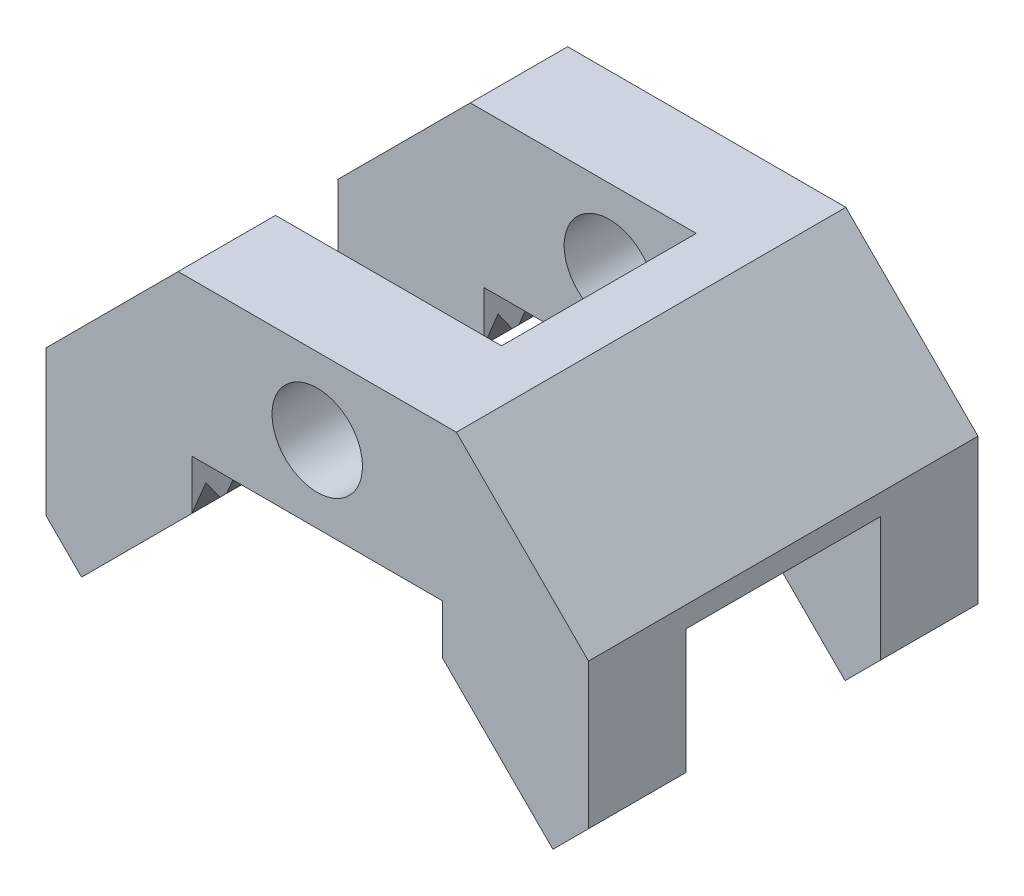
ISO-10303-21;
HEADER;
FILE_DESCRIPTION(('STEP AP214'),'2;1');
FILE_NAME('part.step','',(''),(''),'','','');
FILE_SCHEMA(('AUTOMOTIVE_DESIGN { 1 0 10303 214 1 1 1 1 }'));
ENDSEC;
DATA;
#1=APPLICATION_CONTEXT('core data for automotive mechanical design processes');
#2=APPLICATION_PROTOCOL_DEFINITION('international standard','automotive_design',2000,#1);
#3=PRODUCT_CONTEXT('',#1,'mechanical');
#4=PRODUCT('Part','Part','',(#3));
#5=PRODUCT_RELATED_PRODUCT_CATEGORY('part','',(#4));
#6=PRODUCT_DEFINITION_FORMATION('','',#4);
#7=PRODUCT_DEFINITION_CONTEXT('part definition',#1,'design');
#8=PRODUCT_DEFINITION('design','',#6,#7);
#9=PRODUCT_DEFINITION_SHAPE('','',#8);
#10=(LENGTH_UNIT() NAMED_UNIT(*) SI_UNIT(.MILLI.,.METRE.));
#11=(NAMED_UNIT(*) PLANE_ANGLE_UNIT() SI_UNIT($,.RADIAN.));
#12=(NAMED_UNIT(*) SI_UNIT($,.STERADIAN.) SOLID_ANGLE_UNIT());
#13=UNCERTAINTY_MEASURE_WITH_UNIT(LENGTH_MEASURE(1.E-05),#10,'distance_accuracy_value','');
#14=(GEOMETRIC_REPRESENTATION_CONTEXT(3) GLOBAL_UNCERTAINTY_ASSIGNED_CONTEXT((#13)) GLOBAL_UNIT_ASSIGNED_CONTEXT((#10,
#11,#12)) REPRESENTATION_CONTEXT('',''));
#15=CARTESIAN_POINT('',(0.,0.,0.));
#16=DIRECTION('',(0.,0.,1.));
#17=DIRECTION('',(1.,0.,0.));
#18=AXIS2_PLACEMENT_3D('',#15,#16,#17);
#19=CARTESIAN_POINT('',(-39.,-28.8822509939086,28.));
#20=DIRECTION('',(0.707106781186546,0.707106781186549,0.));
#21=DIRECTION('',(-0.707106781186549,0.707106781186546,0.));
#22=AXIS2_PLACEMENT_3D('',#19,#20,#21);
#23=PLANE('',#22);
#24=DIRECTION('',(-0.499999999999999,0.499999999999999,-0.707106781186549));
#25=VECTOR('',#24,1.);
#26=CARTESIAN_POINT('',(-33.8847763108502,-33.9974746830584,-24.));
#27=LINE('',#26,#25);
#28=CARTESIAN_POINT('',(-33.8847763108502,-33.9974746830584,-24.));
#29=VERTEX_POINT('',#28);
#30=CARTESIAN_POINT('',(-35.2989898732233,-32.5832611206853,-26.));
#31=VERTEX_POINT('',#30);
#32=EDGE_CURVE('E378',#29,#31,#27,.T.);
#33=ORIENTED_EDGE('',*,*,#32,.F.);
#34=DIRECTION('',(0.,0.,-1.));
#35=VECTOR('',#34,1.);
#36=CARTESIAN_POINT('',(-33.8847763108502,-33.9974746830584,28.));
#37=LINE('',#36,#35);
#38=CARTESIAN_POINT('',(-33.8847763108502,-33.9974746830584,-23.));
#39=VERTEX_POINT('',#38);
#40=EDGE_CURVE('E386',#39,#29,#37,.T.);
#41=ORIENTED_EDGE('',*,*,#40,.F.);
#42=DIRECTION('',(0.500000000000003,-0.500000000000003,-0.707106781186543));
#43=VECTOR('',#42,1.);
#44=CARTESIAN_POINT('',(-33.8847763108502,-33.9974746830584,-23.));
#45=LINE('',#44,#43);
#46=CARTESIAN_POINT('',(-35.2989898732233,-32.5832611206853,-21.));
#47=VERTEX_POINT('',#46);
#48=EDGE_CURVE('E729',#47,#39,#45,.T.);
#49=ORIENTED_EDGE('',*,*,#48,.F.);
#50=DIRECTION('',(-0.500000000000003,0.500000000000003,-0.707106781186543));
#51=VECTOR('',#50,1.);
#52=CARTESIAN_POINT('',(-33.8847763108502,-33.9974746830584,-19.));
#53=LINE('',#52,#51);
#54=CARTESIAN_POINT('',(-33.8847763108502,-33.9974746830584,-19.));
#55=VERTEX_POINT('',#54);
#56=EDGE_CURVE('E393',#55,#47,#53,.T.);
#57=ORIENTED_EDGE('',*,*,#56,.F.);
#58=CARTESIAN_POINT('',(-33.8847763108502,-33.9974746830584,-18.));
#59=VERTEX_POINT('',#58);
#60=EDGE_CURVE('E398',#59,#55,#37,.T.);
#61=ORIENTED_EDGE('',*,*,#60,.F.);
#62=DIRECTION('',(0.5,-0.499999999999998,-0.707106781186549));
#63=VECTOR('',#62,1.);
#64=CARTESIAN_POINT('',(-33.8847763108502,-33.9974746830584,-18.));
#65=LINE('',#64,#63);
#66=CARTESIAN_POINT('',(-35.2989898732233,-32.5832611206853,-16.));
#67=VERTEX_POINT('',#66);
#68=EDGE_CURVE('E745',#67,#59,#65,.T.);
#69=ORIENTED_EDGE('',*,*,#68,.F.);
#70=DIRECTION('',(-0.500000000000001,0.499999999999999,-0.707106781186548));
#71=VECTOR('',#70,1.);
#72=CARTESIAN_POINT('',(-33.8847763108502,-33.9974746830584,-14.));
#73=LINE('',#72,#71);
#74=CARTESIAN_POINT('',(-33.8847763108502,-33.9974746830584,-14.));
#75=VERTEX_POINT('',#74);
#76=EDGE_CURVE('E740',#75,#67,#73,.T.);
#77=ORIENTED_EDGE('',*,*,#76,.F.);
#78=DIRECTION('',(0.707106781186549,-0.707106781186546,0.));
#79=VECTOR('',#78,1.);
#80=CARTESIAN_POINT('',(-39.,-28.8822509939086,-14.));
#81=LINE('',#80,#79);
#82=CARTESIAN_POINT('',(-39.,-28.8822509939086,-14.));
#83=VERTEX_POINT('',#82);
#84=EDGE_CURVE('E572',#83,#75,#81,.T.);
#85=ORIENTED_EDGE('',*,*,#84,.F.);
#86=DIRECTION('',(0.,0.,-1.));
#87=VECTOR('',#86,1.);
#88=CARTESIAN_POINT('',(-39.,-28.8822509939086,28.));
#89=LINE('',#88,#87);
#90=CARTESIAN_POINT('',(-39.,-28.8822509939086,-28.));
#91=VERTEX_POINT('',#90);
#92=EDGE_CURVE('E406',#83,#91,#89,.T.);
#93=ORIENTED_EDGE('',*,*,#92,.T.);
#94=DIRECTION('',(0.707106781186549,-0.707106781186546,0.));
#95=VECTOR('',#94,1.);
#96=CARTESIAN_POINT('',(-39.,-28.8822509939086,-28.));
#97=LINE('',#96,#95);
#98=CARTESIAN_POINT('',(-33.8847763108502,-33.9974746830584,-28.));
#99=VERTEX_POINT('',#98);
#100=EDGE_CURVE('E640',#91,#99,#97,.T.);
#101=ORIENTED_EDGE('',*,*,#100,.T.);
#102=DIRECTION('',(0.499999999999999,-0.499999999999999,-0.707106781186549));
#103=VECTOR('',#102,1.);
#104=CARTESIAN_POINT('',(-33.8847763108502,-33.9974746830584,-28.));
#105=LINE('',#104,#103);
#106=EDGE_CURVE('E383',#31,#99,#105,.T.);
#107=ORIENTED_EDGE('',*,*,#106,.F.);
#108=EDGE_LOOP('',(#33,#41,#49,#57,#61,#69,#77,#85,#93,#101,#107));
#109=FACE_BOUND('',#108,.T.);
#110=ADVANCED_FACE('F45',(#109),#23,.F.);
#111=CARTESIAN_POINT('',(-33.8847763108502,-33.9974746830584,28.));
#112=DIRECTION('',(-0.707106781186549,0.707106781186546,0.));
#113=DIRECTION('',(-0.707106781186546,-0.707106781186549,0.));
#114=AXIS2_PLACEMENT_3D('',#111,#112,#113);
#115=PLANE('',#114);
#116=DIRECTION('',(-0.707106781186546,-0.707106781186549,0.));
#117=VECTOR('',#116,1.);
#118=CARTESIAN_POINT('',(-14.0857864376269,-14.198484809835,-24.));
#119=LINE('',#118,#117);
#120=CARTESIAN_POINT('',(-18.,-18.1126983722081,-24.));
#121=VERTEX_POINT('',#120);
#122=EDGE_CURVE('E374',#121,#29,#119,.T.);
#123=ORIENTED_EDGE('',*,*,#122,.F.);
#124=DIRECTION('',(0.,0.,-1.));
#125=VECTOR('',#124,1.);
#126=CARTESIAN_POINT('',(-18.,-18.1126983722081,28.));
#127=LINE('',#126,#125);
#128=CARTESIAN_POINT('',(-18.,-18.1126983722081,-23.));
#129=VERTEX_POINT('',#128);
#130=EDGE_CURVE('E403',#129,#121,#127,.T.);
#131=ORIENTED_EDGE('',*,*,#130,.F.);
#132=DIRECTION('',(-0.707106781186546,-0.707106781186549,0.));
#133=VECTOR('',#132,1.);
#134=CARTESIAN_POINT('',(-14.0857864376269,-14.198484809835,-23.));
#135=LINE('',#134,#133);
#136=EDGE_CURVE('E392',#129,#39,#135,.T.);
#137=ORIENTED_EDGE('',*,*,#136,.T.);
#138=ORIENTED_EDGE('',*,*,#40,.T.);
#139=EDGE_LOOP('',(#123,#131,#137,#138));
#140=FACE_BOUND('',#139,.T.);
#141=ADVANCED_FACE('F394',(#140),#115,.F.);
#142=CARTESIAN_POINT('',(-18.,-18.1126983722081,-18.));
#143=VERTEX_POINT('',#142);
#144=CARTESIAN_POINT('',(-18.,-18.1126983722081,-19.));
#145=VERTEX_POINT('',#144);
#146=EDGE_CURVE('E691',#143,#145,#127,.T.);
#147=ORIENTED_EDGE('',*,*,#146,.F.);
#148=DIRECTION('',(-0.707106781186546,-0.707106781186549,0.));
#149=VECTOR('',#148,1.);
#150=CARTESIAN_POINT('',(-14.0857864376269,-14.198484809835,-18.));
#151=LINE('',#150,#149);
#152=EDGE_CURVE('E722',#143,#59,#151,.T.);
#153=ORIENTED_EDGE('',*,*,#152,.T.);
#154=ORIENTED_EDGE('',*,*,#60,.T.);
#155=DIRECTION('',(-0.707106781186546,-0.707106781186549,0.));
#156=VECTOR('',#155,1.);
#157=CARTESIAN_POINT('',(-14.0857864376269,-14.198484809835,-19.));
#158=LINE('',#157,#156);
#159=EDGE_CURVE('E730',#145,#55,#158,.T.);
#160=ORIENTED_EDGE('',*,*,#159,.F.);
#161=EDGE_LOOP('',(#147,#153,#154,#160));
#162=FACE_BOUND('',#161,.T.);
#163=ADVANCED_FACE('F724',(#162),#115,.F.);
#164=DIRECTION('',(-0.500000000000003,0.500000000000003,-0.707106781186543));
#165=VECTOR('',#164,1.);
#166=CARTESIAN_POINT('',(-33.8847763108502,-33.9974746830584,23.));
#167=LINE('',#166,#165);
#168=CARTESIAN_POINT('',(-33.8847763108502,-33.9974746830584,23.));
#169=VERTEX_POINT('',#168);
#170=CARTESIAN_POINT('',(-35.2989898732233,-32.5832611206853,21.));
#171=VERTEX_POINT('',#170);
#172=EDGE_CURVE('E734',#169,#171,#167,.T.);
#173=ORIENTED_EDGE('',*,*,#172,.F.);
#174=CARTESIAN_POINT('',(-33.8847763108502,-33.9974746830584,24.));
#175=VERTEX_POINT('',#174);
#176=EDGE_CURVE('E399',#175,#169,#37,.T.);
#177=ORIENTED_EDGE('',*,*,#176,.F.);
#178=DIRECTION('',(0.499999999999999,-0.499999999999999,-0.707106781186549));
#179=VECTOR('',#178,1.);
#180=CARTESIAN_POINT('',(-33.8847763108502,-33.9974746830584,24.));
#181=LINE('',#180,#179);
#182=CARTESIAN_POINT('',(-35.2989898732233,-32.5832611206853,26.));
#183=VERTEX_POINT('',#182);
#184=EDGE_CURVE('E746',#183,#175,#181,.T.);
#185=ORIENTED_EDGE('',*,*,#184,.F.);
#186=DIRECTION('',(-0.499999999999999,0.499999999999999,-0.707106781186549));
#187=VECTOR('',#186,1.);
#188=CARTESIAN_POINT('',(-33.8847763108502,-33.9974746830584,28.));
#189=LINE('',#188,#187);
#190=CARTESIAN_POINT('',(-33.8847763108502,-33.9974746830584,28.));
#191=VERTEX_POINT('',#190);
#192=EDGE_CURVE('E744',#191,#183,#189,.T.);
#193=ORIENTED_EDGE('',*,*,#192,.F.);
#194=DIRECTION('',(0.707106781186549,-0.707106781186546,0.));
#195=VECTOR('',#194,1.);
#196=CARTESIAN_POINT('',(-39.,-28.8822509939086,28.));
#197=LINE('',#196,#195);
#198=CARTESIAN_POINT('',(-39.,-28.8822509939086,28.));
#199=VERTEX_POINT('',#198);
#200=EDGE_CURVE('E606',#199,#191,#197,.T.);
#201=ORIENTED_EDGE('',*,*,#200,.F.);
#202=CARTESIAN_POINT('',(-39.,-28.8822509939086,14.));
#203=VERTEX_POINT('',#202);
#204=EDGE_CURVE('E411',#199,#203,#89,.T.);
#205=ORIENTED_EDGE('',*,*,#204,.T.);
#206=DIRECTION('',(0.707106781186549,-0.707106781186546,0.));
#207=VECTOR('',#206,1.);
#208=CARTESIAN_POINT('',(-39.,-28.8822509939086,14.));
#209=LINE('',#208,#207);
#210=CARTESIAN_POINT('',(-33.8847763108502,-33.9974746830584,14.));
#211=VERTEX_POINT('',#210);
#212=EDGE_CURVE('E550',#203,#211,#209,.T.);
#213=ORIENTED_EDGE('',*,*,#212,.T.);
#214=DIRECTION('',(0.500000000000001,-0.499999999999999,-0.707106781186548));
#215=VECTOR('',#214,1.);
#216=CARTESIAN_POINT('',(-33.8847763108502,-33.9974746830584,14.));
#217=LINE('',#216,#215);
#218=CARTESIAN_POINT('',(-35.2989898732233,-32.5832611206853,16.));
#219=VERTEX_POINT('',#218);
#220=EDGE_CURVE('E432',#219,#211,#217,.T.);
#221=ORIENTED_EDGE('',*,*,#220,.F.);
#222=DIRECTION('',(-0.5,0.499999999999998,-0.707106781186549));
#223=VECTOR('',#222,1.);
#224=CARTESIAN_POINT('',(-33.8847763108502,-33.9974746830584,18.));
#225=LINE('',#224,#223);
#226=CARTESIAN_POINT('',(-33.8847763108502,-33.9974746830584,18.));
#227=VERTEX_POINT('',#226);
#228=EDGE_CURVE('E435',#227,#219,#225,.T.);
#229=ORIENTED_EDGE('',*,*,#228,.F.);
#230=CARTESIAN_POINT('',(-33.8847763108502,-33.9974746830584,19.));
#231=VERTEX_POINT('',#230);
#232=EDGE_CURVE('E402',#231,#227,#37,.T.);
#233=ORIENTED_EDGE('',*,*,#232,.F.);
#234=DIRECTION('',(0.500000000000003,-0.500000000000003,-0.707106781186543));
#235=VECTOR('',#234,1.);
#236=CARTESIAN_POINT('',(-33.8847763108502,-33.9974746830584,19.));
#237=LINE('',#236,#235);
#238=EDGE_CURVE('E427',#171,#231,#237,.T.);
#239=ORIENTED_EDGE('',*,*,#238,.F.);
#240=EDGE_LOOP('',(#173,#177,#185,#193,#201,#205,#213,#221,#229,#233,#239));
#241=FACE_BOUND('',#240,.T.);
#242=ADVANCED_FACE('F428',(#241),#23,.F.);
#243=DIRECTION('',(-0.707106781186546,-0.707106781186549,0.));
#244=VECTOR('',#243,1.);
#245=CARTESIAN_POINT('',(-14.0857864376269,-14.198484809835,23.));
#246=LINE('',#245,#244);
#247=CARTESIAN_POINT('',(-18.,-18.1126983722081,23.));
#248=VERTEX_POINT('',#247);
#249=EDGE_CURVE('E752',#248,#169,#246,.T.);
#250=ORIENTED_EDGE('',*,*,#249,.F.);
#251=CARTESIAN_POINT('',(-18.,-18.1126983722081,24.));
#252=VERTEX_POINT('',#251);
#253=EDGE_CURVE('E400',#252,#248,#127,.T.);
#254=ORIENTED_EDGE('',*,*,#253,.F.);
#255=DIRECTION('',(-0.707106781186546,-0.707106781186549,0.));
#256=VECTOR('',#255,1.);
#257=CARTESIAN_POINT('',(-14.0857864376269,-14.198484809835,24.));
#258=LINE('',#257,#256);
#259=EDGE_CURVE('E440',#252,#175,#258,.T.);
#260=ORIENTED_EDGE('',*,*,#259,.T.);
#261=ORIENTED_EDGE('',*,*,#176,.T.);
#262=EDGE_LOOP('',(#250,#254,#260,#261));
#263=FACE_BOUND('',#262,.T.);
#264=ADVANCED_FACE('F865',(#263),#115,.F.);
#265=CARTESIAN_POINT('',(-18.,-18.1126983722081,19.));
#266=VERTEX_POINT('',#265);
#267=CARTESIAN_POINT('',(-18.,-18.1126983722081,18.));
#268=VERTEX_POINT('',#267);
#269=EDGE_CURVE('E401',#266,#268,#127,.T.);
#270=ORIENTED_EDGE('',*,*,#269,.F.);
#271=DIRECTION('',(-0.707106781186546,-0.707106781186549,0.));
#272=VECTOR('',#271,1.);
#273=CARTESIAN_POINT('',(-14.0857864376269,-14.198484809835,19.));
#274=LINE('',#273,#272);
#275=EDGE_CURVE('E421',#266,#231,#274,.T.);
#276=ORIENTED_EDGE('',*,*,#275,.T.);
#277=ORIENTED_EDGE('',*,*,#232,.T.);
#278=DIRECTION('',(-0.707106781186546,-0.707106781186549,0.));
#279=VECTOR('',#278,1.);
#280=CARTESIAN_POINT('',(-14.0857864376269,-14.198484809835,18.));
#281=LINE('',#280,#279);
#282=EDGE_CURVE('E423',#268,#227,#281,.T.);
#283=ORIENTED_EDGE('',*,*,#282,.F.);
#284=EDGE_LOOP('',(#270,#276,#277,#283));
#285=FACE_BOUND('',#284,.T.);
#286=ADVANCED_FACE('F419',(#285),#115,.F.);
#287=CARTESIAN_POINT('',(33.8847763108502,-33.9974746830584,28.));
#288=DIRECTION('',(0.707106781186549,0.707106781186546,0.));
#289=DIRECTION('',(-0.707106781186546,0.707106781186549,0.));
#290=AXIS2_PLACEMENT_3D('',#287,#288,#289);
#291=PLANE('',#290);
#292=DIRECTION('',(0.707106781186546,-0.707106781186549,0.));
#293=VECTOR('',#292,1.);
#294=CARTESIAN_POINT('',(14.0857864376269,-14.198484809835,-23.));
#295=LINE('',#294,#293);
#296=CARTESIAN_POINT('',(18.,-18.1126983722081,-23.));
#297=VERTEX_POINT('',#296);
#298=CARTESIAN_POINT('',(33.8847763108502,-33.9974746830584,-23.));
#299=VERTEX_POINT('',#298);
#300=EDGE_CURVE('E468',#297,#299,#295,.T.);
#301=ORIENTED_EDGE('',*,*,#300,.F.);
#302=DIRECTION('',(0.,0.,-1.));
#303=VECTOR('',#302,1.);
#304=CARTESIAN_POINT('',(18.,-18.1126983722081,28.));
#305=LINE('',#304,#303);
#306=CARTESIAN_POINT('',(18.,-18.1126983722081,-24.));
#307=VERTEX_POINT('',#306);
#308=EDGE_CURVE('E683',#297,#307,#305,.T.);
#309=ORIENTED_EDGE('',*,*,#308,.T.);
#310=DIRECTION('',(0.707106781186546,-0.707106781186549,0.));
#311=VECTOR('',#310,1.);
#312=CARTESIAN_POINT('',(14.0857864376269,-14.198484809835,-24.));
#313=LINE('',#312,#311);
#314=CARTESIAN_POINT('',(33.8847763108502,-33.9974746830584,-24.));
#315=VERTEX_POINT('',#314);
#316=EDGE_CURVE('E501',#307,#315,#313,.T.);
#317=ORIENTED_EDGE('',*,*,#316,.T.);
#318=DIRECTION('',(0.,0.,-1.));
#319=VECTOR('',#318,1.);
#320=CARTESIAN_POINT('',(33.8847763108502,-33.9974746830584,28.));
#321=LINE('',#320,#319);
#322=EDGE_CURVE('E677',#299,#315,#321,.T.);
#323=ORIENTED_EDGE('',*,*,#322,.F.);
#324=EDGE_LOOP('',(#301,#309,#317,#323));
#325=FACE_BOUND('',#324,.T.);
#326=ADVANCED_FACE('F904',(#325),#291,.F.);
#327=CARTESIAN_POINT('',(18.,-18.1126983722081,-18.));
#328=VERTEX_POINT('',#327);
#329=CARTESIAN_POINT('',(18.,-18.1126983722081,-19.));
#330=VERTEX_POINT('',#329);
#331=EDGE_CURVE('E684',#328,#330,#305,.T.);
#332=ORIENTED_EDGE('',*,*,#331,.T.);
#333=DIRECTION('',(0.707106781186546,-0.707106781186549,0.));
#334=VECTOR('',#333,1.);
#335=CARTESIAN_POINT('',(14.0857864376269,-14.198484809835,-19.));
#336=LINE('',#335,#334);
#337=CARTESIAN_POINT('',(33.8847763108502,-33.9974746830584,-19.));
#338=VERTEX_POINT('',#337);
#339=EDGE_CURVE('E454',#330,#338,#336,.T.);
#340=ORIENTED_EDGE('',*,*,#339,.T.);
#341=CARTESIAN_POINT('',(33.8847763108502,-33.9974746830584,-18.));
#342=VERTEX_POINT('',#341);
#343=EDGE_CURVE('E679',#342,#338,#321,.T.);
#344=ORIENTED_EDGE('',*,*,#343,.F.);
#345=DIRECTION('',(0.707106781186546,-0.707106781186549,0.));
#346=VECTOR('',#345,1.);
#347=CARTESIAN_POINT('',(14.0857864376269,-14.198484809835,-18.));
#348=LINE('',#347,#346);
#349=EDGE_CURVE('E480',#328,#342,#348,.T.);
#350=ORIENTED_EDGE('',*,*,#349,.F.);
#351=EDGE_LOOP('',(#332,#340,#344,#350));
#352=FACE_BOUND('',#351,.T.);
#353=ADVANCED_FACE('F910',(#352),#291,.F.);
#354=CARTESIAN_POINT('',(39.,-28.8822509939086,28.));
#355=DIRECTION('',(-0.707106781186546,0.707106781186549,0.));
#356=DIRECTION('',(-0.707106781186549,-0.707106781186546,0.));
#357=AXIS2_PLACEMENT_3D('',#354,#355,#356);
#358=PLANE('',#357);
#359=DIRECTION('',(0.500000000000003,0.500000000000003,0.707106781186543));
#360=VECTOR('',#359,1.);
#361=CARTESIAN_POINT('',(33.8847763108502,-33.9974746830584,-23.));
#362=LINE('',#361,#360);
#363=CARTESIAN_POINT('',(35.2989898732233,-32.5832611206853,-21.));
#364=VERTEX_POINT('',#363);
#365=EDGE_CURVE('E475',#299,#364,#362,.T.);
#366=ORIENTED_EDGE('',*,*,#365,.F.);
#367=ORIENTED_EDGE('',*,*,#322,.T.);
#368=DIRECTION('',(-0.499999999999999,-0.499999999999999,0.707106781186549));
#369=VECTOR('',#368,1.);
#370=CARTESIAN_POINT('',(33.8847763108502,-33.9974746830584,-24.));
#371=LINE('',#370,#369);
#372=CARTESIAN_POINT('',(35.2989898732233,-32.5832611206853,-26.));
#373=VERTEX_POINT('',#372);
#374=EDGE_CURVE('E505',#373,#315,#371,.T.);
#375=ORIENTED_EDGE('',*,*,#374,.F.);
#376=DIRECTION('',(0.499999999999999,0.499999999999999,0.707106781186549));
#377=VECTOR('',#376,1.);
#378=CARTESIAN_POINT('',(33.8847763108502,-33.9974746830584,-28.));
#379=LINE('',#378,#377);
#380=CARTESIAN_POINT('',(33.8847763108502,-33.9974746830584,-28.));
#381=VERTEX_POINT('',#380);
#382=EDGE_CURVE('E497',#381,#373,#379,.T.);
#383=ORIENTED_EDGE('',*,*,#382,.F.);
#384=DIRECTION('',(0.707106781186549,0.707106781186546,0.));
#385=VECTOR('',#384,1.);
#386=CARTESIAN_POINT('',(39.,-28.8822509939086,-28.));
#387=LINE('',#386,#385);
#388=CARTESIAN_POINT('',(39.,-28.8822509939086,-28.));
#389=VERTEX_POINT('',#388);
#390=EDGE_CURVE('E652',#381,#389,#387,.T.);
#391=ORIENTED_EDGE('',*,*,#390,.T.);
#392=DIRECTION('',(0.,0.,-1.));
#393=VECTOR('',#392,1.);
#394=CARTESIAN_POINT('',(39.,-28.8822509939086,28.));
#395=LINE('',#394,#393);
#396=CARTESIAN_POINT('',(39.,-28.8822509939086,-14.));
#397=VERTEX_POINT('',#396);
#398=EDGE_CURVE('E675',#397,#389,#395,.T.);
#399=ORIENTED_EDGE('',*,*,#398,.F.);
#400=DIRECTION('',(0.707106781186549,0.707106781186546,0.));
#401=VECTOR('',#400,1.);
#402=CARTESIAN_POINT('',(39.,-28.8822509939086,-14.));
#403=LINE('',#402,#401);
#404=CARTESIAN_POINT('',(33.8847763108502,-33.9974746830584,-14.));
#405=VERTEX_POINT('',#404);
#406=EDGE_CURVE('E586',#405,#397,#403,.T.);
#407=ORIENTED_EDGE('',*,*,#406,.F.);
#408=DIRECTION('',(-0.500000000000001,-0.499999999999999,0.707106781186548));
#409=VECTOR('',#408,1.);
#410=CARTESIAN_POINT('',(33.8847763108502,-33.9974746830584,-14.));
#411=LINE('',#410,#409);
#412=CARTESIAN_POINT('',(35.2989898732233,-32.5832611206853,-16.));
#413=VERTEX_POINT('',#412);
#414=EDGE_CURVE('E515',#413,#405,#411,.T.);
#415=ORIENTED_EDGE('',*,*,#414,.F.);
#416=DIRECTION('',(0.5,0.499999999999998,0.707106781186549));
#417=VECTOR('',#416,1.);
#418=CARTESIAN_POINT('',(33.8847763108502,-33.9974746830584,-18.));
#419=LINE('',#418,#417);
#420=EDGE_CURVE('E508',#342,#413,#419,.T.);
#421=ORIENTED_EDGE('',*,*,#420,.F.);
#422=ORIENTED_EDGE('',*,*,#343,.T.);
#423=DIRECTION('',(-0.500000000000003,-0.500000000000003,0.707106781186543));
#424=VECTOR('',#423,1.);
#425=CARTESIAN_POINT('',(33.8847763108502,-33.9974746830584,-19.));
#426=LINE('',#425,#424);
#427=EDGE_CURVE('E466',#364,#338,#426,.T.);
#428=ORIENTED_EDGE('',*,*,#427,.F.);
#429=EDGE_LOOP('',(#366,#367,#375,#383,#391,#399,#407,#415,#421,#422,#428));
#430=FACE_BOUND('',#429,.T.);
#431=ADVANCED_FACE('F907',(#430),#358,.F.);
#432=DIRECTION('',(0.707106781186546,-0.707106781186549,0.));
#433=VECTOR('',#432,1.);
#434=CARTESIAN_POINT('',(14.0857864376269,-14.198484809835,24.));
#435=LINE('',#434,#433);
#436=CARTESIAN_POINT('',(18.,-18.1126983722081,24.));
#437=VERTEX_POINT('',#436);
#438=CARTESIAN_POINT('',(33.8847763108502,-33.9974746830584,24.));
#439=VERTEX_POINT('',#438);
#440=EDGE_CURVE('E463',#437,#439,#435,.T.);
#441=ORIENTED_EDGE('',*,*,#440,.F.);
#442=CARTESIAN_POINT('',(18.,-18.1126983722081,23.));
#443=VERTEX_POINT('',#442);
#444=EDGE_CURVE('E682',#437,#443,#305,.T.);
#445=ORIENTED_EDGE('',*,*,#444,.T.);
#446=DIRECTION('',(0.707106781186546,-0.707106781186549,0.));
#447=VECTOR('',#446,1.);
#448=CARTESIAN_POINT('',(14.0857864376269,-14.198484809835,23.));
#449=LINE('',#448,#447);
#450=CARTESIAN_POINT('',(33.8847763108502,-33.9974746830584,23.));
#451=VERTEX_POINT('',#450);
#452=EDGE_CURVE('E483',#443,#451,#449,.T.);
#453=ORIENTED_EDGE('',*,*,#452,.T.);
#454=EDGE_CURVE('E678',#439,#451,#321,.T.);
#455=ORIENTED_EDGE('',*,*,#454,.F.);
#456=EDGE_LOOP('',(#441,#445,#453,#455));
#457=FACE_BOUND('',#456,.T.);
#458=ADVANCED_FACE('F911',(#457),#291,.F.);
#459=CARTESIAN_POINT('',(18.,-18.1126983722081,19.));
#460=VERTEX_POINT('',#459);
#461=CARTESIAN_POINT('',(18.,-18.1126983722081,18.));
#462=VERTEX_POINT('',#461);
#463=EDGE_CURVE('E1376',#460,#462,#305,.T.);
#464=ORIENTED_EDGE('',*,*,#463,.T.);
#465=DIRECTION('',(0.707106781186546,-0.707106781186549,0.));
#466=VECTOR('',#465,1.);
#467=CARTESIAN_POINT('',(14.0857864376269,-14.198484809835,18.));
#468=LINE('',#467,#466);
#469=CARTESIAN_POINT('',(33.8847763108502,-33.9974746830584,18.));
#470=VERTEX_POINT('',#469);
#471=EDGE_CURVE('E492',#462,#470,#468,.T.);
#472=ORIENTED_EDGE('',*,*,#471,.T.);
#473=CARTESIAN_POINT('',(33.8847763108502,-33.9974746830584,19.));
#474=VERTEX_POINT('',#473);
#475=EDGE_CURVE('E1398',#474,#470,#321,.T.);
#476=ORIENTED_EDGE('',*,*,#475,.F.);
#477=DIRECTION('',(0.707106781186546,-0.707106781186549,0.));
#478=VECTOR('',#477,1.);
#479=CARTESIAN_POINT('',(14.0857864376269,-14.198484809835,19.));
#480=LINE('',#479,#478);
#481=EDGE_CURVE('E476',#460,#474,#480,.T.);
#482=ORIENTED_EDGE('',*,*,#481,.F.);
#483=EDGE_LOOP('',(#464,#472,#476,#482));
#484=FACE_BOUND('',#483,.T.);
#485=ADVANCED_FACE('F909',(#484),#291,.F.);
#486=DIRECTION('',(0.499999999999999,0.499999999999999,0.707106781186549));
#487=VECTOR('',#486,1.);
#488=CARTESIAN_POINT('',(33.8847763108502,-33.9974746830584,24.));
#489=LINE('',#488,#487);
#490=CARTESIAN_POINT('',(35.2989898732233,-32.5832611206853,26.));
#491=VERTEX_POINT('',#490);
#492=EDGE_CURVE('E452',#439,#491,#489,.T.);
#493=ORIENTED_EDGE('',*,*,#492,.F.);
#494=ORIENTED_EDGE('',*,*,#454,.T.);
#495=DIRECTION('',(-0.500000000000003,-0.500000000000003,0.707106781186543));
#496=VECTOR('',#495,1.);
#497=CARTESIAN_POINT('',(33.8847763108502,-33.9974746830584,23.));
#498=LINE('',#497,#496);
#499=CARTESIAN_POINT('',(35.2989898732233,-32.5832611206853,21.));
#500=VERTEX_POINT('',#499);
#501=EDGE_CURVE('E477',#500,#451,#498,.T.);
#502=ORIENTED_EDGE('',*,*,#501,.F.);
#503=DIRECTION('',(0.500000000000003,0.500000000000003,0.707106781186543));
#504=VECTOR('',#503,1.);
#505=CARTESIAN_POINT('',(33.8847763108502,-33.9974746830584,19.));
#506=LINE('',#505,#504);
#507=EDGE_CURVE('E459',#474,#500,#506,.T.);
#508=ORIENTED_EDGE('',*,*,#507,.F.);
#509=ORIENTED_EDGE('',*,*,#475,.T.);
#510=DIRECTION('',(-0.5,-0.499999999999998,0.707106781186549));
#511=VECTOR('',#510,1.);
#512=CARTESIAN_POINT('',(33.8847763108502,-33.9974746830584,18.));
#513=LINE('',#512,#511);
#514=CARTESIAN_POINT('',(35.2989898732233,-32.5832611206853,16.));
#515=VERTEX_POINT('',#514);
#516=EDGE_CURVE('E495',#515,#470,#513,.T.);
#517=ORIENTED_EDGE('',*,*,#516,.F.);
#518=DIRECTION('',(0.500000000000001,0.499999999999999,0.707106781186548));
#519=VECTOR('',#518,1.);
#520=CARTESIAN_POINT('',(33.8847763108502,-33.9974746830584,14.));
#521=LINE('',#520,#519);
#522=CARTESIAN_POINT('',(33.8847763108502,-33.9974746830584,14.));
#523=VERTEX_POINT('',#522);
#524=EDGE_CURVE('E486',#523,#515,#521,.T.);
#525=ORIENTED_EDGE('',*,*,#524,.F.);
#526=DIRECTION('',(0.707106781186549,0.707106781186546,0.));
#527=VECTOR('',#526,1.);
#528=CARTESIAN_POINT('',(39.,-28.8822509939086,14.));
#529=LINE('',#528,#527);
#530=CARTESIAN_POINT('',(39.,-28.8822509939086,14.));
#531=VERTEX_POINT('',#530);
#532=EDGE_CURVE('E557',#523,#531,#529,.T.);
#533=ORIENTED_EDGE('',*,*,#532,.T.);
#534=CARTESIAN_POINT('',(39.,-28.8822509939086,28.));
#535=VERTEX_POINT('',#534);
#536=EDGE_CURVE('E671',#535,#531,#395,.T.);
#537=ORIENTED_EDGE('',*,*,#536,.F.);
#538=DIRECTION('',(0.707106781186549,0.707106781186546,0.));
#539=VECTOR('',#538,1.);
#540=CARTESIAN_POINT('',(39.,-28.8822509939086,28.));
#541=LINE('',#540,#539);
#542=CARTESIAN_POINT('',(33.8847763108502,-33.9974746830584,28.));
#543=VERTEX_POINT('',#542);
#544=EDGE_CURVE('E623',#543,#535,#541,.T.);
#545=ORIENTED_EDGE('',*,*,#544,.F.);
#546=DIRECTION('',(-0.499999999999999,-0.499999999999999,0.707106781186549));
#547=VECTOR('',#546,1.);
#548=CARTESIAN_POINT('',(33.8847763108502,-33.9974746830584,28.));
#549=LINE('',#548,#547);
#550=EDGE_CURVE('E456',#491,#543,#549,.T.);
#551=ORIENTED_EDGE('',*,*,#550,.F.);
#552=EDGE_LOOP('',(#493,#494,#502,#508,#509,#517,#525,#533,#537,#545,#551));
#553=FACE_BOUND('',#552,.T.);
#554=ADVANCED_FACE('F914',(#553),#358,.F.);
#555=CARTESIAN_POINT('',(-20.,11.,28.));
#556=DIRECTION('',(0.707106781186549,-0.707106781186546,0.));
#557=DIRECTION('',(0.707106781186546,0.707106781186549,0.));
#558=AXIS2_PLACEMENT_3D('',#555,#556,#557);
#559=PLANE('',#558);
#560=DIRECTION('',(-0.707106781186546,-0.707106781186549,0.));
#561=VECTOR('',#560,1.);
#562=CARTESIAN_POINT('',(-20.,11.,-14.));
#563=LINE('',#562,#561);
#564=CARTESIAN_POINT('',(-20.,11.,-14.));
#565=VERTEX_POINT('',#564);
#566=CARTESIAN_POINT('',(-39.,-8.00000000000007,-14.));
#567=VERTEX_POINT('',#566);
#568=EDGE_CURVE('E573',#565,#567,#563,.T.);
#569=ORIENTED_EDGE('',*,*,#568,.F.);
#570=DIRECTION('',(0.,0.,-1.));
#571=VECTOR('',#570,1.);
#572=CARTESIAN_POINT('',(-20.,11.,28.));
#573=LINE('',#572,#571);
#574=CARTESIAN_POINT('',(-20.,11.,-28.));
#575=VERTEX_POINT('',#574);
#576=EDGE_CURVE('E631',#565,#575,#573,.T.);
#577=ORIENTED_EDGE('',*,*,#576,.T.);
#578=DIRECTION('',(-0.707106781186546,-0.707106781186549,0.));
#579=VECTOR('',#578,1.);
#580=CARTESIAN_POINT('',(-20.,11.,-28.));
#581=LINE('',#580,#579);
#582=CARTESIAN_POINT('',(-39.,-8.00000000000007,-28.));
#583=VERTEX_POINT('',#582);
#584=EDGE_CURVE('E599',#575,#583,#581,.T.);
#585=ORIENTED_EDGE('',*,*,#584,.T.);
#586=DIRECTION('',(0.,0.,-1.));
#587=VECTOR('',#586,1.);
#588=CARTESIAN_POINT('',(-39.,-8.00000000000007,28.));
#589=LINE('',#588,#587);
#590=EDGE_CURVE('E796',#567,#583,#589,.T.);
#591=ORIENTED_EDGE('',*,*,#590,.F.);
#592=EDGE_LOOP('',(#569,#577,#585,#591));
#593=FACE_BOUND('',#592,.T.);
#594=ADVANCED_FACE('F800',(#593),#559,.F.);
#595=CARTESIAN_POINT('',(-39.,-8.00000000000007,28.));
#596=DIRECTION('',(1.,0.,0.));
#597=DIRECTION('',(0.,0.,-1.));
#598=AXIS2_PLACEMENT_3D('',#595,#596,#597);
#599=PLANE('',#598);
#600=DIRECTION('',(0.,-1.,0.));
#601=VECTOR('',#600,1.);
#602=CARTESIAN_POINT('',(-39.,-8.00000000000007,-14.));
#603=LINE('',#602,#601);
#604=EDGE_CURVE('E571',#567,#83,#603,.T.);
#605=ORIENTED_EDGE('',*,*,#604,.F.);
#606=ORIENTED_EDGE('',*,*,#590,.T.);
#607=DIRECTION('',(0.,-1.,0.));
#608=VECTOR('',#607,1.);
#609=CARTESIAN_POINT('',(-39.,-8.00000000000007,-28.));
#610=LINE('',#609,#608);
#611=EDGE_CURVE('E638',#583,#91,#610,.T.);
#612=ORIENTED_EDGE('',*,*,#611,.T.);
#613=ORIENTED_EDGE('',*,*,#92,.F.);
#614=EDGE_LOOP('',(#605,#606,#612,#613));
#615=FACE_BOUND('',#614,.T.);
#616=ADVANCED_FACE('F1246',(#615),#599,.F.);
#617=CARTESIAN_POINT('',(-18.,-18.1126983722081,28.));
#618=DIRECTION('',(-1.,0.,0.));
#619=DIRECTION('',(0.,0.,1.));
#620=AXIS2_PLACEMENT_3D('',#617,#618,#619);
#621=PLANE('',#620);
#622=DIRECTION('',(0.,0.816496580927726,-0.577350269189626));
#623=VECTOR('',#622,1.);
#624=CARTESIAN_POINT('',(-18.,-42.6257334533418,-6.66666666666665));
#625=LINE('',#624,#623);
#626=CARTESIAN_POINT('',(-18.,-15.2842712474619,-26.));
#627=VERTEX_POINT('',#626);
#628=EDGE_CURVE('E12',#121,#627,#625,.T.);
#629=ORIENTED_EDGE('',*,*,#628,.T.);
#630=DIRECTION('',(0.,-0.816496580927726,-0.577350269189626));
#631=VECTOR('',#630,1.);
#632=CARTESIAN_POINT('',(-18.,8.28595479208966,-9.33333333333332));
#633=LINE('',#632,#631);
#634=CARTESIAN_POINT('',(-18.,-18.1126983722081,-28.));
#635=VERTEX_POINT('',#634);
#636=EDGE_CURVE('E453',#627,#635,#633,.T.);
#637=ORIENTED_EDGE('',*,*,#636,.T.);
#638=DIRECTION('',(0.,1.,0.));
#639=VECTOR('',#638,1.);
#640=CARTESIAN_POINT('',(-18.,-18.1126983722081,-28.));
#641=LINE('',#640,#639);
#642=CARTESIAN_POINT('',(-18.,-11.,-28.));
#643=VERTEX_POINT('',#642);
#644=EDGE_CURVE('E641',#635,#643,#641,.T.);
#645=ORIENTED_EDGE('',*,*,#644,.T.);
#646=DIRECTION('',(0.,0.,-1.));
#647=VECTOR('',#646,1.);
#648=CARTESIAN_POINT('',(-18.,-11.,28.));
#649=LINE('',#648,#647);
#650=CARTESIAN_POINT('',(-18.,-11.,-14.));
#651=VERTEX_POINT('',#650);
#652=EDGE_CURVE('E689',#651,#643,#649,.T.);
#653=ORIENTED_EDGE('',*,*,#652,.F.);
#654=DIRECTION('',(0.,1.,0.));
#655=VECTOR('',#654,1.);
#656=CARTESIAN_POINT('',(-18.,-18.1126983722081,-14.));
#657=LINE('',#656,#655);
#658=CARTESIAN_POINT('',(-18.,-18.1126983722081,-14.));
#659=VERTEX_POINT('',#658);
#660=EDGE_CURVE('E583',#659,#651,#657,.T.);
#661=ORIENTED_EDGE('',*,*,#660,.F.);
#662=DIRECTION('',(0.,0.816496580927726,-0.577350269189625));
#663=VECTOR('',#662,1.);
#664=CARTESIAN_POINT('',(-18.,-37.9116882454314,0.));
#665=LINE('',#664,#663);
#666=CARTESIAN_POINT('',(-18.,-15.2842712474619,-16.));
#667=VERTEX_POINT('',#666);
#668=EDGE_CURVE('E446',#659,#667,#665,.T.);
#669=ORIENTED_EDGE('',*,*,#668,.T.);
#670=DIRECTION('',(0.,-0.816496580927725,-0.577350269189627));
#671=VECTOR('',#670,1.);
#672=CARTESIAN_POINT('',(-18.,3.57190958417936,-2.66666666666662));
#673=LINE('',#672,#671);
#674=EDGE_CURVE('E49',#667,#143,#673,.T.);
#675=ORIENTED_EDGE('',*,*,#674,.T.);
#676=ORIENTED_EDGE('',*,*,#146,.T.);
#677=DIRECTION('',(0.,0.81649658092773,-0.577350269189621));
#678=VECTOR('',#677,1.);
#679=CARTESIAN_POINT('',(-18.,-40.2687108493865,-3.33333333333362));
#680=LINE('',#679,#678);
#681=CARTESIAN_POINT('',(-18.,-15.2842712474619,-21.));
#682=VERTEX_POINT('',#681);
#683=EDGE_CURVE('E709',#145,#682,#680,.T.);
#684=ORIENTED_EDGE('',*,*,#683,.T.);
#685=DIRECTION('',(0.,-0.81649658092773,-0.577350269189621));
#686=VECTOR('',#685,1.);
#687=CARTESIAN_POINT('',(-18.,5.92893218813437,-6.00000000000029));
#688=LINE('',#687,#686);
#689=EDGE_CURVE('E715',#682,#129,#688,.T.);
#690=ORIENTED_EDGE('',*,*,#689,.T.);
#691=ORIENTED_EDGE('',*,*,#130,.T.);
#692=EDGE_LOOP('',(#629,#637,#645,#653,#661,#669,#675,#676,#684,#690,#691));
#693=FACE_BOUND('',#692,.T.);
#694=ADVANCED_FACE('F720',(#693),#621,.F.);
#695=CARTESIAN_POINT('',(18.,-18.1126983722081,28.));
#696=DIRECTION('',(1.,0.,0.));
#697=DIRECTION('',(0.,0.,-1.));
#698=AXIS2_PLACEMENT_3D('',#695,#696,#697);
#699=PLANE('',#698);
#700=DIRECTION('',(0.,0.81649658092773,0.577350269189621));
#701=VECTOR('',#700,1.);
#702=CARTESIAN_POINT('',(18.,5.92893218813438,-6.00000000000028));
#703=LINE('',#702,#701);
#704=CARTESIAN_POINT('',(18.,-15.2842712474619,-21.));
#705=VERTEX_POINT('',#704);
#706=EDGE_CURVE('E838',#297,#705,#703,.T.);
#707=ORIENTED_EDGE('',*,*,#706,.T.);
#708=DIRECTION('',(0.,-0.81649658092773,0.577350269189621));
#709=VECTOR('',#708,1.);
#710=CARTESIAN_POINT('',(18.,-40.2687108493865,-3.33333333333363));
#711=LINE('',#710,#709);
#712=EDGE_CURVE('E839',#705,#330,#711,.T.);
#713=ORIENTED_EDGE('',*,*,#712,.T.);
#714=ORIENTED_EDGE('',*,*,#331,.F.);
#715=DIRECTION('',(0.,0.816496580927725,0.577350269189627));
#716=VECTOR('',#715,1.);
#717=CARTESIAN_POINT('',(18.,3.57190958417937,-2.66666666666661));
#718=LINE('',#717,#716);
#719=CARTESIAN_POINT('',(18.,-15.2842712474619,-16.));
#720=VERTEX_POINT('',#719);
#721=EDGE_CURVE('E831',#328,#720,#718,.T.);
#722=ORIENTED_EDGE('',*,*,#721,.T.);
#723=DIRECTION('',(0.,-0.816496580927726,0.577350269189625));
#724=VECTOR('',#723,1.);
#725=CARTESIAN_POINT('',(18.,-37.9116882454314,0.));
#726=LINE('',#725,#724);
#727=CARTESIAN_POINT('',(18.,-18.1126983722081,-14.));
#728=VERTEX_POINT('',#727);
#729=EDGE_CURVE('E828',#720,#728,#726,.T.);
#730=ORIENTED_EDGE('',*,*,#729,.T.);
#731=DIRECTION('',(0.,-1.,0.));
#732=VECTOR('',#731,1.);
#733=CARTESIAN_POINT('',(18.,-18.1126983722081,-14.));
#734=LINE('',#733,#732);
#735=CARTESIAN_POINT('',(18.,-11.,-14.));
#736=VERTEX_POINT('',#735);
#737=EDGE_CURVE('E593',#736,#728,#734,.T.);
#738=ORIENTED_EDGE('',*,*,#737,.F.);
#739=DIRECTION('',(0.,0.,-1.));
#740=VECTOR('',#739,1.);
#741=CARTESIAN_POINT('',(18.,-11.,28.));
#742=LINE('',#741,#740);
#743=CARTESIAN_POINT('',(18.,-11.,-28.));
#744=VERTEX_POINT('',#743);
#745=EDGE_CURVE('E687',#736,#744,#742,.T.);
#746=ORIENTED_EDGE('',*,*,#745,.T.);
#747=DIRECTION('',(0.,-1.,0.));
#748=VECTOR('',#747,1.);
#749=CARTESIAN_POINT('',(18.,-18.1126983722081,-28.));
#750=LINE('',#749,#748);
#751=CARTESIAN_POINT('',(18.,-18.1126983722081,-28.));
#752=VERTEX_POINT('',#751);
#753=EDGE_CURVE('E647',#744,#752,#750,.T.);
#754=ORIENTED_EDGE('',*,*,#753,.T.);
#755=DIRECTION('',(0.,0.816496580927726,0.577350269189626));
#756=VECTOR('',#755,1.);
#757=CARTESIAN_POINT('',(18.,8.28595479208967,-9.33333333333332));
#758=LINE('',#757,#756);
#759=CARTESIAN_POINT('',(18.,-15.2842712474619,-26.));
#760=VERTEX_POINT('',#759);
#761=EDGE_CURVE('E464',#752,#760,#758,.T.);
#762=ORIENTED_EDGE('',*,*,#761,.T.);
#763=DIRECTION('',(0.,-0.816496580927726,0.577350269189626));
#764=VECTOR('',#763,1.);
#765=CARTESIAN_POINT('',(18.,-42.6257334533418,-6.66666666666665));
#766=LINE('',#765,#764);
#767=EDGE_CURVE('E830',#760,#307,#766,.T.);
#768=ORIENTED_EDGE('',*,*,#767,.T.);
#769=ORIENTED_EDGE('',*,*,#308,.F.);
#770=EDGE_LOOP('',(#707,#713,#714,#722,#730,#738,#746,#754,#762,#768,#769));
#771=FACE_BOUND('',#770,.T.);
#772=ADVANCED_FACE('F901',(#771),#699,.F.);
#773=CARTESIAN_POINT('',(20.,11.,28.));
#774=DIRECTION('',(0.,-1.,0.));
#775=DIRECTION('',(1.,0.,0.));
#776=AXIS2_PLACEMENT_3D('',#773,#774,#775);
#777=PLANE('',#776);
#778=DIRECTION('',(0.,0.,-1.));
#779=VECTOR('',#778,1.);
#780=CARTESIAN_POINT('',(20.,11.,28.));
#781=LINE('',#780,#779);
#782=CARTESIAN_POINT('',(20.,11.,28.));
#783=VERTEX_POINT('',#782);
#784=CARTESIAN_POINT('',(20.,11.,-28.));
#785=VERTEX_POINT('',#784);
#786=EDGE_CURVE('E666',#783,#785,#781,.T.);
#787=ORIENTED_EDGE('',*,*,#786,.T.);
#788=DIRECTION('',(-1.,0.,0.));
#789=VECTOR('',#788,1.);
#790=CARTESIAN_POINT('',(20.,11.,-28.));
#791=LINE('',#790,#789);
#792=EDGE_CURVE('E610',#785,#575,#791,.T.);
#793=ORIENTED_EDGE('',*,*,#792,.T.);
#794=ORIENTED_EDGE('',*,*,#576,.F.);
#795=DIRECTION('',(-1.,0.,0.));
#796=VECTOR('',#795,1.);
#797=CARTESIAN_POINT('',(20.,11.,-14.));
#798=LINE('',#797,#796);
#799=CARTESIAN_POINT('',(12.5,11.,-14.));
#800=VERTEX_POINT('',#799);
#801=EDGE_CURVE('E569',#800,#565,#798,.T.);
#802=ORIENTED_EDGE('',*,*,#801,.F.);
#803=DIRECTION('',(0.,0.,1.));
#804=VECTOR('',#803,1.);
#805=CARTESIAN_POINT('',(12.5,11.,-14.));
#806=LINE('',#805,#804);
#807=CARTESIAN_POINT('',(12.5,11.,14.));
#808=VERTEX_POINT('',#807);
#809=EDGE_CURVE('E528',#800,#808,#806,.T.);
#810=ORIENTED_EDGE('',*,*,#809,.T.);
#811=DIRECTION('',(-1.,0.,0.));
#812=VECTOR('',#811,1.);
#813=CARTESIAN_POINT('',(20.,11.,14.));
#814=LINE('',#813,#812);
#815=CARTESIAN_POINT('',(-20.,11.,14.));
#816=VERTEX_POINT('',#815);
#817=EDGE_CURVE('E538',#808,#816,#814,.T.);
#818=ORIENTED_EDGE('',*,*,#817,.T.);
#819=CARTESIAN_POINT('',(-20.,11.,28.));
#820=VERTEX_POINT('',#819);
#821=EDGE_CURVE('E663',#820,#816,#573,.T.);
#822=ORIENTED_EDGE('',*,*,#821,.F.);
#823=DIRECTION('',(-1.,0.,0.));
#824=VECTOR('',#823,1.);
#825=CARTESIAN_POINT('',(20.,11.,28.));
#826=LINE('',#825,#824);
#827=EDGE_CURVE('E633',#783,#820,#826,.T.);
#828=ORIENTED_EDGE('',*,*,#827,.F.);
#829=EDGE_LOOP('',(#787,#793,#794,#802,#810,#818,#822,#828));
#830=FACE_BOUND('',#829,.T.);
#831=ADVANCED_FACE('F788',(#830),#777,.F.);
#832=CARTESIAN_POINT('',(0.,0.,28.));
#833=DIRECTION('',(0.,0.,-1.));
#834=DIRECTION('',(-1.,0.,0.));
#835=AXIS2_PLACEMENT_3D('',#832,#833,#834);
#836=CYLINDRICAL_SURFACE('',#835,6.5);
#837=CARTESIAN_POINT('',(0.,0.,-28.));
#838=DIRECTION('',(0.,0.,1.));
#839=DIRECTION('',(1.,0.,0.));
#840=AXIS2_PLACEMENT_3D('',#837,#838,#839);
#841=CIRCLE('',#840,6.5);
#842=CARTESIAN_POINT('',(6.5,0.,-28.));
#843=VERTEX_POINT('',#842);
#844=EDGE_CURVE('E596',#843,#843,#841,.T.);
#845=ORIENTED_EDGE('',*,*,#844,.F.);
#846=EDGE_LOOP('',(#845));
#847=FACE_BOUND('',#846,.T.);
#848=CARTESIAN_POINT('',(0.,0.,-14.));
#849=DIRECTION('',(0.,0.,1.));
#850=DIRECTION('',(1.,0.,0.));
#851=AXIS2_PLACEMENT_3D('',#848,#849,#850);
#852=CIRCLE('',#851,6.5);
#853=CARTESIAN_POINT('',(6.5,0.,-14.));
#854=VERTEX_POINT('',#853);
#855=EDGE_CURVE('E566',#854,#854,#852,.T.);
#856=ORIENTED_EDGE('',*,*,#855,.T.);
#857=EDGE_LOOP('',(#856));
#858=FACE_BOUND('',#857,.T.);
#859=ADVANCED_FACE('F926',(#847,#858),#836,.F.);
#860=CARTESIAN_POINT('',(0.,0.,28.));
#861=DIRECTION('',(0.,0.,1.));
#862=DIRECTION('',(1.,0.,0.));
#863=AXIS2_PLACEMENT_3D('',#860,#861,#862);
#864=PLANE('',#863);
#865=DIRECTION('',(-0.707106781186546,-0.707106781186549,0.));
#866=VECTOR('',#865,1.);
#867=CARTESIAN_POINT('',(-20.,11.,28.));
#868=LINE('',#867,#866);
#869=CARTESIAN_POINT('',(-39.,-8.00000000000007,28.));
#870=VERTEX_POINT('',#869);
#871=EDGE_CURVE('E602',#820,#870,#868,.T.);
#872=ORIENTED_EDGE('',*,*,#871,.T.);
#873=DIRECTION('',(0.,-1.,0.));
#874=VECTOR('',#873,1.);
#875=CARTESIAN_POINT('',(-39.,-8.00000000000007,28.));
#876=LINE('',#875,#874);
#877=EDGE_CURVE('E607',#870,#199,#876,.T.);
#878=ORIENTED_EDGE('',*,*,#877,.T.);
#879=ORIENTED_EDGE('',*,*,#200,.T.);
#880=DIRECTION('',(0.707106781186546,0.707106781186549,0.));
#881=VECTOR('',#880,1.);
#882=CARTESIAN_POINT('',(-33.8847763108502,-33.9974746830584,28.));
#883=LINE('',#882,#881);
#884=CARTESIAN_POINT('',(-18.,-18.1126983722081,28.));
#885=VERTEX_POINT('',#884);
#886=EDGE_CURVE('E615',#191,#885,#883,.T.);
#887=ORIENTED_EDGE('',*,*,#886,.T.);
#888=DIRECTION('',(0.,1.,0.));
#889=VECTOR('',#888,1.);
#890=CARTESIAN_POINT('',(-18.,-18.1126983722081,28.));
#891=LINE('',#890,#889);
#892=CARTESIAN_POINT('',(-18.,-11.,28.));
#893=VERTEX_POINT('',#892);
#894=EDGE_CURVE('E612',#885,#893,#891,.T.);
#895=ORIENTED_EDGE('',*,*,#894,.T.);
#896=DIRECTION('',(1.,0.,0.));
#897=VECTOR('',#896,1.);
#898=CARTESIAN_POINT('',(-18.,-11.,28.));
#899=LINE('',#898,#897);
#900=CARTESIAN_POINT('',(18.,-11.,28.));
#901=VERTEX_POINT('',#900);
#902=EDGE_CURVE('E620',#893,#901,#899,.T.);
#903=ORIENTED_EDGE('',*,*,#902,.T.);
#904=DIRECTION('',(0.,-1.,0.));
#905=VECTOR('',#904,1.);
#906=CARTESIAN_POINT('',(18.,-18.1126983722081,28.));
#907=LINE('',#906,#905);
#908=CARTESIAN_POINT('',(18.,-18.1126983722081,28.));
#909=VERTEX_POINT('',#908);
#910=EDGE_CURVE('E619',#901,#909,#907,.T.);
#911=ORIENTED_EDGE('',*,*,#910,.T.);
#912=DIRECTION('',(0.707106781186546,-0.707106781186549,0.));
#913=VECTOR('',#912,1.);
#914=CARTESIAN_POINT('',(33.8847763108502,-33.9974746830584,28.));
#915=LINE('',#914,#913);
#916=EDGE_CURVE('E625',#909,#543,#915,.T.);
#917=ORIENTED_EDGE('',*,*,#916,.T.);
#918=ORIENTED_EDGE('',*,*,#544,.T.);
#919=DIRECTION('',(0.,1.,0.));
#920=VECTOR('',#919,1.);
#921=CARTESIAN_POINT('',(39.,-8.00000000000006,28.));
#922=LINE('',#921,#920);
#923=CARTESIAN_POINT('',(39.,-8.00000000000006,28.));
#924=VERTEX_POINT('',#923);
#925=EDGE_CURVE('E630',#535,#924,#922,.T.);
#926=ORIENTED_EDGE('',*,*,#925,.T.);
#927=DIRECTION('',(-0.707106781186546,0.707106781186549,0.));
#928=VECTOR('',#927,1.);
#929=CARTESIAN_POINT('',(20.,11.,28.));
#930=LINE('',#929,#928);
#931=EDGE_CURVE('E629',#924,#783,#930,.T.);
#932=ORIENTED_EDGE('',*,*,#931,.T.);
#933=ORIENTED_EDGE('',*,*,#827,.T.);
#934=EDGE_LOOP('',(#872,#878,#879,#887,#895,#903,#911,#917,#918,#926,#932,#933));
#935=FACE_BOUND('',#934,.T.);
#936=CARTESIAN_POINT('',(0.,0.,28.));
#937=DIRECTION('',(0.,0.,1.));
#938=DIRECTION('',(1.,0.,0.));
#939=AXIS2_PLACEMENT_3D('',#936,#937,#938);
#940=CIRCLE('',#939,6.5);
#941=CARTESIAN_POINT('',(6.5,0.,28.));
#942=VERTEX_POINT('',#941);
#943=EDGE_CURVE('E600',#942,#942,#940,.T.);
#944=ORIENTED_EDGE('',*,*,#943,.F.);
#945=EDGE_LOOP('',(#944));
#946=FACE_BOUND('',#945,.T.);
#947=ADVANCED_FACE('F852',(#935,#946),#864,.T.);
#948=CARTESIAN_POINT('',(0.,0.,-28.));
#949=DIRECTION('',(0.,0.,1.));
#950=DIRECTION('',(1.,0.,0.));
#951=AXIS2_PLACEMENT_3D('',#948,#949,#950);
#952=PLANE('',#951);
#953=ORIENTED_EDGE('',*,*,#584,.F.);
#954=ORIENTED_EDGE('',*,*,#792,.F.);
#955=DIRECTION('',(-0.707106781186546,0.707106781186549,0.));
#956=VECTOR('',#955,1.);
#957=CARTESIAN_POINT('',(20.,11.,-28.));
#958=LINE('',#957,#956);
#959=CARTESIAN_POINT('',(39.,-8.00000000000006,-28.));
#960=VERTEX_POINT('',#959);
#961=EDGE_CURVE('E659',#960,#785,#958,.T.);
#962=ORIENTED_EDGE('',*,*,#961,.F.);
#963=DIRECTION('',(0.,1.,0.));
#964=VECTOR('',#963,1.);
#965=CARTESIAN_POINT('',(39.,-8.00000000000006,-28.));
#966=LINE('',#965,#964);
#967=EDGE_CURVE('E660',#389,#960,#966,.T.);
#968=ORIENTED_EDGE('',*,*,#967,.F.);
#969=ORIENTED_EDGE('',*,*,#390,.F.);
#970=DIRECTION('',(0.707106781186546,-0.707106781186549,0.));
#971=VECTOR('',#970,1.);
#972=CARTESIAN_POINT('',(33.8847763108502,-33.9974746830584,-28.));
#973=LINE('',#972,#971);
#974=EDGE_CURVE('E655',#752,#381,#973,.T.);
#975=ORIENTED_EDGE('',*,*,#974,.F.);
#976=ORIENTED_EDGE('',*,*,#753,.F.);
#977=DIRECTION('',(1.,0.,0.));
#978=VECTOR('',#977,1.);
#979=CARTESIAN_POINT('',(-18.,-11.,-28.));
#980=LINE('',#979,#978);
#981=EDGE_CURVE('E646',#643,#744,#980,.T.);
#982=ORIENTED_EDGE('',*,*,#981,.F.);
#983=ORIENTED_EDGE('',*,*,#644,.F.);
#984=DIRECTION('',(0.707106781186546,0.707106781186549,0.));
#985=VECTOR('',#984,1.);
#986=CARTESIAN_POINT('',(-33.8847763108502,-33.9974746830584,-28.));
#987=LINE('',#986,#985);
#988=EDGE_CURVE('E643',#99,#635,#987,.T.);
#989=ORIENTED_EDGE('',*,*,#988,.F.);
#990=ORIENTED_EDGE('',*,*,#100,.F.);
#991=ORIENTED_EDGE('',*,*,#611,.F.);
#992=EDGE_LOOP('',(#953,#954,#962,#968,#969,#975,#976,#982,#983,#989,#990,#991));
#993=FACE_BOUND('',#992,.T.);
#994=ORIENTED_EDGE('',*,*,#844,.T.);
#995=EDGE_LOOP('',(#994));
#996=FACE_BOUND('',#995,.T.);
#997=ADVANCED_FACE('F775',(#993,#996),#952,.F.);
#998=ORIENTED_EDGE('',*,*,#821,.T.);
#999=DIRECTION('',(-0.707106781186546,-0.707106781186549,0.));
#1000=VECTOR('',#999,1.);
#1001=CARTESIAN_POINT('',(-20.,11.,14.));
#1002=LINE('',#1001,#1000);
#1003=CARTESIAN_POINT('',(-39.,-8.00000000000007,14.));
#1004=VERTEX_POINT('',#1003);
#1005=EDGE_CURVE('E541',#816,#1004,#1002,.T.);
#1006=ORIENTED_EDGE('',*,*,#1005,.T.);
#1007=EDGE_CURVE('E797',#870,#1004,#589,.T.);
#1008=ORIENTED_EDGE('',*,*,#1007,.F.);
#1009=ORIENTED_EDGE('',*,*,#871,.F.);
#1010=EDGE_LOOP('',(#998,#1006,#1008,#1009));
#1011=FACE_BOUND('',#1010,.T.);
#1012=ADVANCED_FACE('F42',(#1011),#559,.F.);
#1013=ORIENTED_EDGE('',*,*,#1007,.T.);
#1014=DIRECTION('',(0.,-1.,0.));
#1015=VECTOR('',#1014,1.);
#1016=CARTESIAN_POINT('',(-39.,-8.00000000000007,14.));
#1017=LINE('',#1016,#1015);
#1018=EDGE_CURVE('E542',#1004,#203,#1017,.T.);
#1019=ORIENTED_EDGE('',*,*,#1018,.T.);
#1020=ORIENTED_EDGE('',*,*,#204,.F.);
#1021=ORIENTED_EDGE('',*,*,#877,.F.);
#1022=EDGE_LOOP('',(#1013,#1019,#1020,#1021));
#1023=FACE_BOUND('',#1022,.T.);
#1024=ADVANCED_FACE('F892',(#1023),#599,.F.);
#1025=DIRECTION('',(0.,0.81649658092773,-0.577350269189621));
#1026=VECTOR('',#1025,1.);
#1027=CARTESIAN_POINT('',(-18.,-20.4697209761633,24.6666666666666));
#1028=LINE('',#1027,#1026);
#1029=CARTESIAN_POINT('',(-18.,-15.2842712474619,21.));
#1030=VERTEX_POINT('',#1029);
#1031=EDGE_CURVE('E708',#248,#1030,#1028,.T.);
#1032=ORIENTED_EDGE('',*,*,#1031,.T.);
#1033=DIRECTION('',(0.,-0.81649658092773,-0.577350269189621));
#1034=VECTOR('',#1033,1.);
#1035=CARTESIAN_POINT('',(-18.,-13.8700576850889,22.));
#1036=LINE('',#1035,#1034);
#1037=EDGE_CURVE('E710',#1030,#266,#1036,.T.);
#1038=ORIENTED_EDGE('',*,*,#1037,.T.);
#1039=ORIENTED_EDGE('',*,*,#269,.T.);
#1040=DIRECTION('',(0.,0.816496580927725,-0.577350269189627));
#1041=VECTOR('',#1040,1.);
#1042=CARTESIAN_POINT('',(-18.,-22.8267435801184,21.3333333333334));
#1043=LINE('',#1042,#1041);
#1044=CARTESIAN_POINT('',(-18.,-15.2842712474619,16.));
#1045=VERTEX_POINT('',#1044);
#1046=EDGE_CURVE('E704',#268,#1045,#1043,.T.);
#1047=ORIENTED_EDGE('',*,*,#1046,.T.);
#1048=DIRECTION('',(0.,-0.816496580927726,-0.577350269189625));
#1049=VECTOR('',#1048,1.);
#1050=CARTESIAN_POINT('',(-18.,-11.5130350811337,18.6666666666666));
#1051=LINE('',#1050,#1049);
#1052=CARTESIAN_POINT('',(-18.,-18.1126983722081,14.));
#1053=VERTEX_POINT('',#1052);
#1054=EDGE_CURVE('E443',#1045,#1053,#1051,.T.);
#1055=ORIENTED_EDGE('',*,*,#1054,.T.);
#1056=DIRECTION('',(0.,1.,0.));
#1057=VECTOR('',#1056,1.);
#1058=CARTESIAN_POINT('',(-18.,-18.1126983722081,14.));
#1059=LINE('',#1058,#1057);
#1060=CARTESIAN_POINT('',(-18.,-11.,14.));
#1061=VERTEX_POINT('',#1060);
#1062=EDGE_CURVE('E552',#1053,#1061,#1059,.T.);
#1063=ORIENTED_EDGE('',*,*,#1062,.T.);
#1064=EDGE_CURVE('E693',#893,#1061,#649,.T.);
#1065=ORIENTED_EDGE('',*,*,#1064,.F.);
#1066=ORIENTED_EDGE('',*,*,#894,.F.);
#1067=DIRECTION('',(0.,0.816496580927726,-0.577350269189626));
#1068=VECTOR('',#1067,1.);
#1069=CARTESIAN_POINT('',(-18.,-18.1126983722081,28.));
#1070=LINE('',#1069,#1068);
#1071=CARTESIAN_POINT('',(-18.,-15.2842712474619,26.));
#1072=VERTEX_POINT('',#1071);
#1073=EDGE_CURVE('E843',#885,#1072,#1070,.T.);
#1074=ORIENTED_EDGE('',*,*,#1073,.T.);
#1075=DIRECTION('',(0.,-0.816496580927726,-0.577350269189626));
#1076=VECTOR('',#1075,1.);
#1077=CARTESIAN_POINT('',(-18.,-16.227080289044,25.3333333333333));
#1078=LINE('',#1077,#1076);
#1079=EDGE_CURVE('E845',#1072,#252,#1078,.T.);
#1080=ORIENTED_EDGE('',*,*,#1079,.T.);
#1081=ORIENTED_EDGE('',*,*,#253,.T.);
#1082=EDGE_LOOP('',(#1032,#1038,#1039,#1047,#1055,#1063,#1065,#1066,#1074,#1080,#1081));
#1083=FACE_BOUND('',#1082,.T.);
#1084=ADVANCED_FACE('F702',(#1083),#621,.F.);
#1085=CARTESIAN_POINT('',(-18.,-11.,28.));
#1086=DIRECTION('',(0.,1.,0.));
#1087=DIRECTION('',(-1.,0.,0.));
#1088=AXIS2_PLACEMENT_3D('',#1085,#1086,#1087);
#1089=PLANE('',#1088);
#1090=DIRECTION('',(0.,0.,1.));
#1091=VECTOR('',#1090,1.);
#1092=CARTESIAN_POINT('',(12.5,-11.,-14.));
#1093=LINE('',#1092,#1091);
#1094=CARTESIAN_POINT('',(12.5,-11.,-14.));
#1095=VERTEX_POINT('',#1094);
#1096=CARTESIAN_POINT('',(12.5,-11.,14.));
#1097=VERTEX_POINT('',#1096);
#1098=EDGE_CURVE('E534',#1095,#1097,#1093,.T.);
#1099=ORIENTED_EDGE('',*,*,#1098,.F.);
#1100=DIRECTION('',(1.,0.,0.));
#1101=VECTOR('',#1100,1.);
#1102=CARTESIAN_POINT('',(-18.,-11.,-14.));
#1103=LINE('',#1102,#1101);
#1104=EDGE_CURVE('E581',#651,#1095,#1103,.T.);
#1105=ORIENTED_EDGE('',*,*,#1104,.F.);
#1106=ORIENTED_EDGE('',*,*,#652,.T.);
#1107=ORIENTED_EDGE('',*,*,#981,.T.);
#1108=ORIENTED_EDGE('',*,*,#745,.F.);
#1109=DIRECTION('',(1.,0.,0.));
#1110=VECTOR('',#1109,1.);
#1111=CARTESIAN_POINT('',(12.5,-11.,-14.));
#1112=LINE('',#1111,#1110);
#1113=CARTESIAN_POINT('',(39.,-11.,-14.));
#1114=VERTEX_POINT('',#1113);
#1115=EDGE_CURVE('E521',#736,#1114,#1112,.T.);
#1116=ORIENTED_EDGE('',*,*,#1115,.T.);
#1117=DIRECTION('',(0.,0.,1.));
#1118=VECTOR('',#1117,1.);
#1119=CARTESIAN_POINT('',(39.,-11.,-14.));
#1120=LINE('',#1119,#1118);
#1121=CARTESIAN_POINT('',(39.,-11.,14.));
#1122=VERTEX_POINT('',#1121);
#1123=EDGE_CURVE('E529',#1114,#1122,#1120,.T.);
#1124=ORIENTED_EDGE('',*,*,#1123,.T.);
#1125=DIRECTION('',(1.,0.,0.));
#1126=VECTOR('',#1125,1.);
#1127=CARTESIAN_POINT('',(12.5,-11.,14.));
#1128=LINE('',#1127,#1126);
#1129=CARTESIAN_POINT('',(18.,-11.,14.));
#1130=VERTEX_POINT('',#1129);
#1131=EDGE_CURVE('E524',#1130,#1122,#1128,.T.);
#1132=ORIENTED_EDGE('',*,*,#1131,.F.);
#1133=EDGE_CURVE('E688',#901,#1130,#742,.T.);
#1134=ORIENTED_EDGE('',*,*,#1133,.F.);
#1135=ORIENTED_EDGE('',*,*,#902,.F.);
#1136=ORIENTED_EDGE('',*,*,#1064,.T.);
#1137=DIRECTION('',(1.,0.,0.));
#1138=VECTOR('',#1137,1.);
#1139=CARTESIAN_POINT('',(-18.,-11.,14.));
#1140=LINE('',#1139,#1138);
#1141=EDGE_CURVE('E551',#1061,#1097,#1140,.T.);
#1142=ORIENTED_EDGE('',*,*,#1141,.T.);
#1143=EDGE_LOOP('',(#1099,#1105,#1106,#1107,#1108,#1116,#1124,#1132,#1134,#1135,#1136,#1142));
#1144=FACE_BOUND('',#1143,.T.);
#1145=ADVANCED_FACE('F777',(#1144),#1089,.F.);
#1146=DIRECTION('',(0.,0.816496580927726,0.577350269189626));
#1147=VECTOR('',#1146,1.);
#1148=CARTESIAN_POINT('',(18.,-16.227080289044,25.3333333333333));
#1149=LINE('',#1148,#1147);
#1150=CARTESIAN_POINT('',(18.,-15.2842712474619,26.));
#1151=VERTEX_POINT('',#1150);
#1152=EDGE_CURVE('E821',#437,#1151,#1149,.T.);
#1153=ORIENTED_EDGE('',*,*,#1152,.T.);
#1154=DIRECTION('',(0.,-0.816496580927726,0.577350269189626));
#1155=VECTOR('',#1154,1.);
#1156=CARTESIAN_POINT('',(18.,-18.1126983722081,28.));
#1157=LINE('',#1156,#1155);
#1158=EDGE_CURVE('E823',#1151,#909,#1157,.T.);
#1159=ORIENTED_EDGE('',*,*,#1158,.T.);
#1160=ORIENTED_EDGE('',*,*,#910,.F.);
#1161=ORIENTED_EDGE('',*,*,#1133,.T.);
#1162=DIRECTION('',(0.,-1.,0.));
#1163=VECTOR('',#1162,1.);
#1164=CARTESIAN_POINT('',(18.,-18.1126983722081,14.));
#1165=LINE('',#1164,#1163);
#1166=CARTESIAN_POINT('',(18.,-18.1126983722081,14.));
#1167=VERTEX_POINT('',#1166);
#1168=EDGE_CURVE('E562',#1130,#1167,#1165,.T.);
#1169=ORIENTED_EDGE('',*,*,#1168,.T.);
#1170=DIRECTION('',(0.,0.816496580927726,0.577350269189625));
#1171=VECTOR('',#1170,1.);
#1172=CARTESIAN_POINT('',(18.,-11.5130350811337,18.6666666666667));
#1173=LINE('',#1172,#1171);
#1174=CARTESIAN_POINT('',(18.,-15.2842712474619,16.));
#1175=VERTEX_POINT('',#1174);
#1176=EDGE_CURVE('E818',#1167,#1175,#1173,.T.);
#1177=ORIENTED_EDGE('',*,*,#1176,.T.);
#1178=DIRECTION('',(0.,-0.816496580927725,0.577350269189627));
#1179=VECTOR('',#1178,1.);
#1180=CARTESIAN_POINT('',(18.,-22.8267435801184,21.3333333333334));
#1181=LINE('',#1180,#1179);
#1182=EDGE_CURVE('E814',#1175,#462,#1181,.T.);
#1183=ORIENTED_EDGE('',*,*,#1182,.T.);
#1184=ORIENTED_EDGE('',*,*,#463,.F.);
#1185=DIRECTION('',(0.,0.81649658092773,0.577350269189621));
#1186=VECTOR('',#1185,1.);
#1187=CARTESIAN_POINT('',(18.,-13.8700576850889,22.));
#1188=LINE('',#1187,#1186);
#1189=CARTESIAN_POINT('',(18.,-15.2842712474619,21.));
#1190=VERTEX_POINT('',#1189);
#1191=EDGE_CURVE('E801',#460,#1190,#1188,.T.);
#1192=ORIENTED_EDGE('',*,*,#1191,.T.);
#1193=DIRECTION('',(0.,-0.81649658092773,0.577350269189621));
#1194=VECTOR('',#1193,1.);
#1195=CARTESIAN_POINT('',(18.,-20.4697209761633,24.6666666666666));
#1196=LINE('',#1195,#1194);
#1197=EDGE_CURVE('E815',#1190,#443,#1196,.T.);
#1198=ORIENTED_EDGE('',*,*,#1197,.T.);
#1199=ORIENTED_EDGE('',*,*,#444,.F.);
#1200=EDGE_LOOP('',(#1153,#1159,#1160,#1161,#1169,#1177,#1183,#1184,#1192,#1198,#1199));
#1201=FACE_BOUND('',#1200,.T.);
#1202=ADVANCED_FACE('F896',(#1201),#699,.F.);
#1203=CARTESIAN_POINT('',(39.,-8.00000000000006,28.));
#1204=DIRECTION('',(-1.,0.,0.));
#1205=DIRECTION('',(0.,-1.,0.));
#1206=AXIS2_PLACEMENT_3D('',#1203,#1204,#1205);
#1207=PLANE('',#1206);
#1208=ORIENTED_EDGE('',*,*,#1123,.F.);
#1209=DIRECTION('',(0.,1.,0.));
#1210=VECTOR('',#1209,1.);
#1211=CARTESIAN_POINT('',(39.,-8.00000000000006,-14.));
#1212=LINE('',#1211,#1210);
#1213=EDGE_CURVE('E584',#397,#1114,#1212,.T.);
#1214=ORIENTED_EDGE('',*,*,#1213,.F.);
#1215=ORIENTED_EDGE('',*,*,#398,.T.);
#1216=ORIENTED_EDGE('',*,*,#967,.T.);
#1217=DIRECTION('',(0.,0.,-1.));
#1218=VECTOR('',#1217,1.);
#1219=CARTESIAN_POINT('',(39.,-8.00000000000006,28.));
#1220=LINE('',#1219,#1218);
#1221=EDGE_CURVE('E667',#924,#960,#1220,.T.);
#1222=ORIENTED_EDGE('',*,*,#1221,.F.);
#1223=ORIENTED_EDGE('',*,*,#925,.F.);
#1224=ORIENTED_EDGE('',*,*,#536,.T.);
#1225=DIRECTION('',(0.,1.,0.));
#1226=VECTOR('',#1225,1.);
#1227=CARTESIAN_POINT('',(39.,-8.00000000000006,14.));
#1228=LINE('',#1227,#1226);
#1229=EDGE_CURVE('E560',#531,#1122,#1228,.T.);
#1230=ORIENTED_EDGE('',*,*,#1229,.T.);
#1231=EDGE_LOOP('',(#1208,#1214,#1215,#1216,#1222,#1223,#1224,#1230));
#1232=FACE_BOUND('',#1231,.T.);
#1233=ADVANCED_FACE('F903',(#1232),#1207,.F.);
#1234=CARTESIAN_POINT('',(20.,11.,28.));
#1235=DIRECTION('',(-0.707106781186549,-0.707106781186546,0.));
#1236=DIRECTION('',(0.707106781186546,-0.707106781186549,0.));
#1237=AXIS2_PLACEMENT_3D('',#1234,#1235,#1236);
#1238=PLANE('',#1237);
#1239=ORIENTED_EDGE('',*,*,#1221,.T.);
#1240=ORIENTED_EDGE('',*,*,#961,.T.);
#1241=ORIENTED_EDGE('',*,*,#786,.F.);
#1242=ORIENTED_EDGE('',*,*,#931,.F.);
#1243=EDGE_LOOP('',(#1239,#1240,#1241,#1242));
#1244=FACE_BOUND('',#1243,.T.);
#1245=ADVANCED_FACE('F916',(#1244),#1238,.F.);
#1246=CARTESIAN_POINT('',(0.,0.,14.));
#1247=DIRECTION('',(0.,0.,1.));
#1248=DIRECTION('',(1.,0.,0.));
#1249=AXIS2_PLACEMENT_3D('',#1246,#1247,#1248);
#1250=CIRCLE('',#1249,6.5);
#1251=CARTESIAN_POINT('',(6.5,0.,14.));
#1252=VERTEX_POINT('',#1251);
#1253=EDGE_CURVE('E531',#1252,#1252,#1250,.T.);
#1254=ORIENTED_EDGE('',*,*,#1253,.F.);
#1255=EDGE_LOOP('',(#1254));
#1256=FACE_BOUND('',#1255,.T.);
#1257=ORIENTED_EDGE('',*,*,#943,.T.);
#1258=EDGE_LOOP('',(#1257));
#1259=FACE_BOUND('',#1258,.T.);
#1260=ADVANCED_FACE('F925',(#1256,#1259),#836,.F.);
#1261=CARTESIAN_POINT('',(0.,-11.4987373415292,-14.));
#1262=DIRECTION('',(0.,0.,1.));
#1263=DIRECTION('',(1.,0.,0.));
#1264=AXIS2_PLACEMENT_3D('',#1261,#1262,#1263);
#1265=PLANE('',#1264);
#1266=ORIENTED_EDGE('',*,*,#855,.F.);
#1267=EDGE_LOOP('',(#1266));
#1268=FACE_BOUND('',#1267,.T.);
#1269=ORIENTED_EDGE('',*,*,#1104,.T.);
#1270=DIRECTION('',(0.,-1.,0.));
#1271=VECTOR('',#1270,1.);
#1272=CARTESIAN_POINT('',(12.5,11.,-14.));
#1273=LINE('',#1272,#1271);
#1274=EDGE_CURVE('E517',#800,#1095,#1273,.T.);
#1275=ORIENTED_EDGE('',*,*,#1274,.F.);
#1276=ORIENTED_EDGE('',*,*,#801,.T.);
#1277=ORIENTED_EDGE('',*,*,#568,.T.);
#1278=ORIENTED_EDGE('',*,*,#604,.T.);
#1279=ORIENTED_EDGE('',*,*,#84,.T.);
#1280=DIRECTION('',(0.707106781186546,0.707106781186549,0.));
#1281=VECTOR('',#1280,1.);
#1282=CARTESIAN_POINT('',(-33.8847763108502,-33.9974746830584,-14.));
#1283=LINE('',#1282,#1281);
#1284=EDGE_CURVE('E576',#75,#659,#1283,.T.);
#1285=ORIENTED_EDGE('',*,*,#1284,.T.);
#1286=ORIENTED_EDGE('',*,*,#660,.T.);
#1287=EDGE_LOOP('',(#1269,#1275,#1276,#1277,#1278,#1279,#1285,#1286));
#1288=FACE_BOUND('',#1287,.T.);
#1289=ADVANCED_FACE('F784',(#1268,#1288),#1265,.T.);
#1290=CARTESIAN_POINT('',(0.,-11.4987373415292,14.));
#1291=DIRECTION('',(0.,0.,1.));
#1292=DIRECTION('',(1.,0.,0.));
#1293=AXIS2_PLACEMENT_3D('',#1290,#1291,#1292);
#1294=PLANE('',#1293);
#1295=ORIENTED_EDGE('',*,*,#1253,.T.);
#1296=EDGE_LOOP('',(#1295));
#1297=FACE_BOUND('',#1296,.T.);
#1298=ORIENTED_EDGE('',*,*,#1062,.F.);
#1299=DIRECTION('',(0.707106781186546,0.707106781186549,0.));
#1300=VECTOR('',#1299,1.);
#1301=CARTESIAN_POINT('',(-33.8847763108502,-33.9974746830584,14.));
#1302=LINE('',#1301,#1300);
#1303=EDGE_CURVE('E548',#211,#1053,#1302,.T.);
#1304=ORIENTED_EDGE('',*,*,#1303,.F.);
#1305=ORIENTED_EDGE('',*,*,#212,.F.);
#1306=ORIENTED_EDGE('',*,*,#1018,.F.);
#1307=ORIENTED_EDGE('',*,*,#1005,.F.);
#1308=ORIENTED_EDGE('',*,*,#817,.F.);
#1309=DIRECTION('',(0.,-1.,0.));
#1310=VECTOR('',#1309,1.);
#1311=CARTESIAN_POINT('',(12.5,11.,14.));
#1312=LINE('',#1311,#1310);
#1313=EDGE_CURVE('E519',#808,#1097,#1312,.T.);
#1314=ORIENTED_EDGE('',*,*,#1313,.T.);
#1315=ORIENTED_EDGE('',*,*,#1141,.F.);
#1316=EDGE_LOOP('',(#1298,#1304,#1305,#1306,#1307,#1308,#1314,#1315));
#1317=FACE_BOUND('',#1316,.T.);
#1318=ADVANCED_FACE('F938',(#1297,#1317),#1294,.F.);
#1319=CARTESIAN_POINT('',(12.5,11.,-14.));
#1320=DIRECTION('',(-1.,0.,0.));
#1321=DIRECTION('',(0.,-1.,0.));
#1322=AXIS2_PLACEMENT_3D('',#1319,#1320,#1321);
#1323=PLANE('',#1322);
#1324=ORIENTED_EDGE('',*,*,#1313,.F.);
#1325=ORIENTED_EDGE('',*,*,#809,.F.);
#1326=ORIENTED_EDGE('',*,*,#1274,.T.);
#1327=ORIENTED_EDGE('',*,*,#1098,.T.);
#1328=EDGE_LOOP('',(#1324,#1325,#1326,#1327));
#1329=FACE_BOUND('',#1328,.T.);
#1330=ADVANCED_FACE('F790',(#1329),#1323,.T.);
#1331=ORIENTED_EDGE('',*,*,#737,.T.);
#1332=DIRECTION('',(0.707106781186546,-0.707106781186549,0.));
#1333=VECTOR('',#1332,1.);
#1334=CARTESIAN_POINT('',(33.8847763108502,-33.9974746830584,-14.));
#1335=LINE('',#1334,#1333);
#1336=EDGE_CURVE('E587',#728,#405,#1335,.T.);
#1337=ORIENTED_EDGE('',*,*,#1336,.T.);
#1338=ORIENTED_EDGE('',*,*,#406,.T.);
#1339=ORIENTED_EDGE('',*,*,#1213,.T.);
#1340=ORIENTED_EDGE('',*,*,#1115,.F.);
#1341=EDGE_LOOP('',(#1331,#1337,#1338,#1339,#1340));
#1342=FACE_BOUND('',#1341,.T.);
#1343=ADVANCED_FACE('F939',(#1342),#1265,.T.);
#1344=ORIENTED_EDGE('',*,*,#1131,.T.);
#1345=ORIENTED_EDGE('',*,*,#1229,.F.);
#1346=ORIENTED_EDGE('',*,*,#532,.F.);
#1347=DIRECTION('',(0.707106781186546,-0.707106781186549,0.));
#1348=VECTOR('',#1347,1.);
#1349=CARTESIAN_POINT('',(33.8847763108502,-33.9974746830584,14.));
#1350=LINE('',#1349,#1348);
#1351=EDGE_CURVE('E561',#1167,#523,#1350,.T.);
#1352=ORIENTED_EDGE('',*,*,#1351,.F.);
#1353=ORIENTED_EDGE('',*,*,#1168,.F.);
#1354=EDGE_LOOP('',(#1344,#1345,#1346,#1352,#1353));
#1355=FACE_BOUND('',#1354,.T.);
#1356=ADVANCED_FACE('F933',(#1355),#1294,.F.);
#1357=CARTESIAN_POINT('',(14.0857864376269,-14.198484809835,23.));
#1358=DIRECTION('',(0.499999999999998,0.499999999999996,0.707106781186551));
#1359=DIRECTION('',(0.816496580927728,0.,-0.577350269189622));
#1360=AXIS2_PLACEMENT_3D('',#1357,#1358,#1359);
#1361=PLANE('',#1360);
#1362=DIRECTION('',(0.707106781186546,-0.707106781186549,0.));
#1363=VECTOR('',#1362,1.);
#1364=CARTESIAN_POINT('',(15.5,-12.7842712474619,21.));
#1365=LINE('',#1364,#1363);
#1366=EDGE_CURVE('E481',#1190,#500,#1365,.T.);
#1367=ORIENTED_EDGE('',*,*,#1366,.T.);
#1368=ORIENTED_EDGE('',*,*,#501,.T.);
#1369=ORIENTED_EDGE('',*,*,#452,.F.);
#1370=ORIENTED_EDGE('',*,*,#1197,.F.);
#1371=EDGE_LOOP('',(#1367,#1368,#1369,#1370));
#1372=FACE_BOUND('',#1371,.T.);
#1373=ADVANCED_FACE('F940',(#1372),#1361,.F.);
#1374=CARTESIAN_POINT('',(14.0857864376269,-14.198484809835,19.));
#1375=DIRECTION('',(0.499999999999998,0.499999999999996,-0.707106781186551));
#1376=DIRECTION('',(-0.816496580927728,0.,-0.577350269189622));
#1377=AXIS2_PLACEMENT_3D('',#1374,#1375,#1376);
#1378=PLANE('',#1377);
#1379=ORIENTED_EDGE('',*,*,#481,.T.);
#1380=ORIENTED_EDGE('',*,*,#507,.T.);
#1381=ORIENTED_EDGE('',*,*,#1366,.F.);
#1382=ORIENTED_EDGE('',*,*,#1191,.F.);
#1383=EDGE_LOOP('',(#1379,#1380,#1381,#1382));
#1384=FACE_BOUND('',#1383,.T.);
#1385=ADVANCED_FACE('F975',(#1384),#1378,.F.);
#1386=CARTESIAN_POINT('',(14.0857864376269,-14.198484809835,14.));
#1387=DIRECTION('',(0.500000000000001,0.499999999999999,-0.707106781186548));
#1388=DIRECTION('',(-0.816496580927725,0.,-0.577350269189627));
#1389=AXIS2_PLACEMENT_3D('',#1386,#1387,#1388);
#1390=PLANE('',#1389);
#1391=ORIENTED_EDGE('',*,*,#1351,.T.);
#1392=ORIENTED_EDGE('',*,*,#524,.T.);
#1393=DIRECTION('',(0.707106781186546,-0.707106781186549,0.));
#1394=VECTOR('',#1393,1.);
#1395=CARTESIAN_POINT('',(15.5,-12.7842712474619,16.));
#1396=LINE('',#1395,#1394);
#1397=EDGE_CURVE('E489',#1175,#515,#1396,.T.);
#1398=ORIENTED_EDGE('',*,*,#1397,.F.);
#1399=ORIENTED_EDGE('',*,*,#1176,.F.);
#1400=EDGE_LOOP('',(#1391,#1392,#1398,#1399));
#1401=FACE_BOUND('',#1400,.T.);
#1402=ADVANCED_FACE('F966',(#1401),#1390,.F.);
#1403=CARTESIAN_POINT('',(14.0857864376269,-14.198484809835,18.));
#1404=DIRECTION('',(0.500000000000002,0.5,0.707106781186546));
#1405=DIRECTION('',(0.816496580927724,0.,-0.577350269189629));
#1406=AXIS2_PLACEMENT_3D('',#1403,#1404,#1405);
#1407=PLANE('',#1406);
#1408=ORIENTED_EDGE('',*,*,#1397,.T.);
#1409=ORIENTED_EDGE('',*,*,#516,.T.);
#1410=ORIENTED_EDGE('',*,*,#471,.F.);
#1411=ORIENTED_EDGE('',*,*,#1182,.F.);
#1412=EDGE_LOOP('',(#1408,#1409,#1410,#1411));
#1413=FACE_BOUND('',#1412,.T.);
#1414=ADVANCED_FACE('F964',(#1413),#1407,.F.);
#1415=CARTESIAN_POINT('',(14.0857864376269,-14.198484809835,28.));
#1416=DIRECTION('',(0.500000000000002,0.5,0.707106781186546));
#1417=DIRECTION('',(0.816496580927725,0.,-0.577350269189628));
#1418=AXIS2_PLACEMENT_3D('',#1415,#1416,#1417);
#1419=PLANE('',#1418);
#1420=DIRECTION('',(0.707106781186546,-0.707106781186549,0.));
#1421=VECTOR('',#1420,1.);
#1422=CARTESIAN_POINT('',(15.5,-12.7842712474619,26.));
#1423=LINE('',#1422,#1421);
#1424=EDGE_CURVE('E465',#1151,#491,#1423,.T.);
#1425=ORIENTED_EDGE('',*,*,#1424,.T.);
#1426=ORIENTED_EDGE('',*,*,#550,.T.);
#1427=ORIENTED_EDGE('',*,*,#916,.F.);
#1428=ORIENTED_EDGE('',*,*,#1158,.F.);
#1429=EDGE_LOOP('',(#1425,#1426,#1427,#1428));
#1430=FACE_BOUND('',#1429,.T.);
#1431=ADVANCED_FACE('F967',(#1430),#1419,.F.);
#1432=CARTESIAN_POINT('',(14.0857864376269,-14.198484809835,24.));
#1433=DIRECTION('',(0.500000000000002,0.5,-0.707106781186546));
#1434=DIRECTION('',(-0.816496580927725,0.,-0.577350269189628));
#1435=AXIS2_PLACEMENT_3D('',#1432,#1433,#1434);
#1436=PLANE('',#1435);
#1437=ORIENTED_EDGE('',*,*,#440,.T.);
#1438=ORIENTED_EDGE('',*,*,#492,.T.);
#1439=ORIENTED_EDGE('',*,*,#1424,.F.);
#1440=ORIENTED_EDGE('',*,*,#1152,.F.);
#1441=EDGE_LOOP('',(#1437,#1438,#1439,#1440));
#1442=FACE_BOUND('',#1441,.T.);
#1443=ADVANCED_FACE('F959',(#1442),#1436,.F.);
#1444=CARTESIAN_POINT('',(14.0857864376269,-14.198484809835,-24.));
#1445=DIRECTION('',(0.500000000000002,0.5,0.707106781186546));
#1446=DIRECTION('',(0.816496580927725,0.,-0.577350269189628));
#1447=AXIS2_PLACEMENT_3D('',#1444,#1445,#1446);
#1448=PLANE('',#1447);
#1449=DIRECTION('',(0.707106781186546,-0.707106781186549,0.));
#1450=VECTOR('',#1449,1.);
#1451=CARTESIAN_POINT('',(15.5,-12.7842712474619,-26.));
#1452=LINE('',#1451,#1450);
#1453=EDGE_CURVE('E498',#760,#373,#1452,.T.);
#1454=ORIENTED_EDGE('',*,*,#1453,.T.);
#1455=ORIENTED_EDGE('',*,*,#374,.T.);
#1456=ORIENTED_EDGE('',*,*,#316,.F.);
#1457=ORIENTED_EDGE('',*,*,#767,.F.);
#1458=EDGE_LOOP('',(#1454,#1455,#1456,#1457));
#1459=FACE_BOUND('',#1458,.T.);
#1460=ADVANCED_FACE('F958',(#1459),#1448,.F.);
#1461=CARTESIAN_POINT('',(14.0857864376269,-14.198484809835,-28.));
#1462=DIRECTION('',(0.500000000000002,0.5,-0.707106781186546));
#1463=DIRECTION('',(-0.816496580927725,0.,-0.577350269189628));
#1464=AXIS2_PLACEMENT_3D('',#1461,#1462,#1463);
#1465=PLANE('',#1464);
#1466=ORIENTED_EDGE('',*,*,#974,.T.);
#1467=ORIENTED_EDGE('',*,*,#382,.T.);
#1468=ORIENTED_EDGE('',*,*,#1453,.F.);
#1469=ORIENTED_EDGE('',*,*,#761,.F.);
#1470=EDGE_LOOP('',(#1466,#1467,#1468,#1469));
#1471=FACE_BOUND('',#1470,.T.);
#1472=ADVANCED_FACE('F954',(#1471),#1465,.F.);
#1473=CARTESIAN_POINT('',(14.0857864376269,-14.198484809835,-18.));
#1474=DIRECTION('',(0.500000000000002,0.5,-0.707106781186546));
#1475=DIRECTION('',(-0.816496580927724,0.,-0.577350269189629));
#1476=AXIS2_PLACEMENT_3D('',#1473,#1474,#1475);
#1477=PLANE('',#1476);
#1478=ORIENTED_EDGE('',*,*,#349,.T.);
#1479=ORIENTED_EDGE('',*,*,#420,.T.);
#1480=DIRECTION('',(0.707106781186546,-0.707106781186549,0.));
#1481=VECTOR('',#1480,1.);
#1482=CARTESIAN_POINT('',(15.5,-12.7842712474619,-16.));
#1483=LINE('',#1482,#1481);
#1484=EDGE_CURVE('E507',#720,#413,#1483,.T.);
#1485=ORIENTED_EDGE('',*,*,#1484,.F.);
#1486=ORIENTED_EDGE('',*,*,#721,.F.);
#1487=EDGE_LOOP('',(#1478,#1479,#1485,#1486));
#1488=FACE_BOUND('',#1487,.T.);
#1489=ADVANCED_FACE('F947',(#1488),#1477,.F.);
#1490=CARTESIAN_POINT('',(14.0857864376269,-14.198484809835,-14.));
#1491=DIRECTION('',(0.500000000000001,0.499999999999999,0.707106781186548));
#1492=DIRECTION('',(0.816496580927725,0.,-0.577350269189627));
#1493=AXIS2_PLACEMENT_3D('',#1490,#1491,#1492);
#1494=PLANE('',#1493);
#1495=ORIENTED_EDGE('',*,*,#1484,.T.);
#1496=ORIENTED_EDGE('',*,*,#414,.T.);
#1497=ORIENTED_EDGE('',*,*,#1336,.F.);
#1498=ORIENTED_EDGE('',*,*,#729,.F.);
#1499=EDGE_LOOP('',(#1495,#1496,#1497,#1498));
#1500=FACE_BOUND('',#1499,.T.);
#1501=ADVANCED_FACE('F948',(#1500),#1494,.F.);
#1502=CARTESIAN_POINT('',(14.0857864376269,-14.198484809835,-19.));
#1503=DIRECTION('',(0.499999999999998,0.499999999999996,0.707106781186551));
#1504=DIRECTION('',(0.816496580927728,0.,-0.577350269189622));
#1505=AXIS2_PLACEMENT_3D('',#1502,#1503,#1504);
#1506=PLANE('',#1505);
#1507=DIRECTION('',(0.707106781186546,-0.707106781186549,0.));
#1508=VECTOR('',#1507,1.);
#1509=CARTESIAN_POINT('',(15.5,-12.7842712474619,-21.));
#1510=LINE('',#1509,#1508);
#1511=EDGE_CURVE('E469',#705,#364,#1510,.T.);
#1512=ORIENTED_EDGE('',*,*,#1511,.T.);
#1513=ORIENTED_EDGE('',*,*,#427,.T.);
#1514=ORIENTED_EDGE('',*,*,#339,.F.);
#1515=ORIENTED_EDGE('',*,*,#712,.F.);
#1516=EDGE_LOOP('',(#1512,#1513,#1514,#1515));
#1517=FACE_BOUND('',#1516,.T.);
#1518=ADVANCED_FACE('F949',(#1517),#1506,.F.);
#1519=CARTESIAN_POINT('',(14.0857864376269,-14.198484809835,-23.));
#1520=DIRECTION('',(0.499999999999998,0.499999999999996,-0.707106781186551));
#1521=DIRECTION('',(-0.816496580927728,0.,-0.577350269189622));
#1522=AXIS2_PLACEMENT_3D('',#1519,#1520,#1521);
#1523=PLANE('',#1522);
#1524=ORIENTED_EDGE('',*,*,#300,.T.);
#1525=ORIENTED_EDGE('',*,*,#365,.T.);
#1526=ORIENTED_EDGE('',*,*,#1511,.F.);
#1527=ORIENTED_EDGE('',*,*,#706,.F.);
#1528=EDGE_LOOP('',(#1524,#1525,#1526,#1527));
#1529=FACE_BOUND('',#1528,.T.);
#1530=ADVANCED_FACE('F985',(#1529),#1523,.F.);
#1531=CARTESIAN_POINT('',(-14.0857864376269,-14.198484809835,28.));
#1532=DIRECTION('',(-0.500000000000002,0.5,0.707106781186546));
#1533=DIRECTION('',(0.816496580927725,0.,0.577350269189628));
#1534=AXIS2_PLACEMENT_3D('',#1531,#1532,#1533);
#1535=PLANE('',#1534);
#1536=ORIENTED_EDGE('',*,*,#886,.F.);
#1537=ORIENTED_EDGE('',*,*,#192,.T.);
#1538=DIRECTION('',(-0.707106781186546,-0.707106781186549,0.));
#1539=VECTOR('',#1538,1.);
#1540=CARTESIAN_POINT('',(-15.5,-12.7842712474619,26.));
#1541=LINE('',#1540,#1539);
#1542=EDGE_CURVE('E438',#1072,#183,#1541,.T.);
#1543=ORIENTED_EDGE('',*,*,#1542,.F.);
#1544=ORIENTED_EDGE('',*,*,#1073,.F.);
#1545=EDGE_LOOP('',(#1536,#1537,#1543,#1544));
#1546=FACE_BOUND('',#1545,.T.);
#1547=ADVANCED_FACE('F855',(#1546),#1535,.F.);
#1548=CARTESIAN_POINT('',(-14.0857864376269,-14.198484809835,24.));
#1549=DIRECTION('',(-0.500000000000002,0.5,-0.707106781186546));
#1550=DIRECTION('',(-0.816496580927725,0.,0.577350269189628));
#1551=AXIS2_PLACEMENT_3D('',#1548,#1549,#1550);
#1552=PLANE('',#1551);
#1553=ORIENTED_EDGE('',*,*,#1542,.T.);
#1554=ORIENTED_EDGE('',*,*,#184,.T.);
#1555=ORIENTED_EDGE('',*,*,#259,.F.);
#1556=ORIENTED_EDGE('',*,*,#1079,.F.);
#1557=EDGE_LOOP('',(#1553,#1554,#1555,#1556));
#1558=FACE_BOUND('',#1557,.T.);
#1559=ADVANCED_FACE('F863',(#1558),#1552,.F.);
#1560=CARTESIAN_POINT('',(-14.0857864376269,-14.198484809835,18.));
#1561=DIRECTION('',(-0.500000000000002,0.5,0.707106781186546));
#1562=DIRECTION('',(0.816496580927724,0.,0.577350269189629));
#1563=AXIS2_PLACEMENT_3D('',#1560,#1561,#1562);
#1564=PLANE('',#1563);
#1565=ORIENTED_EDGE('',*,*,#282,.T.);
#1566=ORIENTED_EDGE('',*,*,#228,.T.);
#1567=DIRECTION('',(-0.707106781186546,-0.707106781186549,0.));
#1568=VECTOR('',#1567,1.);
#1569=CARTESIAN_POINT('',(-15.5,-12.7842712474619,16.));
#1570=LINE('',#1569,#1568);
#1571=EDGE_CURVE('E442',#1045,#219,#1570,.T.);
#1572=ORIENTED_EDGE('',*,*,#1571,.F.);
#1573=ORIENTED_EDGE('',*,*,#1046,.F.);
#1574=EDGE_LOOP('',(#1565,#1566,#1572,#1573));
#1575=FACE_BOUND('',#1574,.T.);
#1576=ADVANCED_FACE('F872',(#1575),#1564,.F.);
#1577=CARTESIAN_POINT('',(-14.0857864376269,-14.198484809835,14.));
#1578=DIRECTION('',(-0.500000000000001,0.499999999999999,-0.707106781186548));
#1579=DIRECTION('',(-0.816496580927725,0.,0.577350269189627));
#1580=AXIS2_PLACEMENT_3D('',#1577,#1578,#1579);
#1581=PLANE('',#1580);
#1582=ORIENTED_EDGE('',*,*,#1571,.T.);
#1583=ORIENTED_EDGE('',*,*,#220,.T.);
#1584=ORIENTED_EDGE('',*,*,#1303,.T.);
#1585=ORIENTED_EDGE('',*,*,#1054,.F.);
#1586=EDGE_LOOP('',(#1582,#1583,#1584,#1585));
#1587=FACE_BOUND('',#1586,.T.);
#1588=ADVANCED_FACE('F866',(#1587),#1581,.F.);
#1589=CARTESIAN_POINT('',(-14.0857864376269,-14.198484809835,19.));
#1590=DIRECTION('',(-0.499999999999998,0.499999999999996,-0.707106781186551));
#1591=DIRECTION('',(-0.816496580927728,0.,0.577350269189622));
#1592=AXIS2_PLACEMENT_3D('',#1589,#1590,#1591);
#1593=PLANE('',#1592);
#1594=DIRECTION('',(-0.707106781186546,-0.707106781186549,0.));
#1595=VECTOR('',#1594,1.);
#1596=CARTESIAN_POINT('',(-15.5,-12.7842712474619,21.));
#1597=LINE('',#1596,#1595);
#1598=EDGE_CURVE('E756',#1030,#171,#1597,.T.);
#1599=ORIENTED_EDGE('',*,*,#1598,.T.);
#1600=ORIENTED_EDGE('',*,*,#238,.T.);
#1601=ORIENTED_EDGE('',*,*,#275,.F.);
#1602=ORIENTED_EDGE('',*,*,#1037,.F.);
#1603=EDGE_LOOP('',(#1599,#1600,#1601,#1602));
#1604=FACE_BOUND('',#1603,.T.);
#1605=ADVANCED_FACE('F864',(#1604),#1593,.F.);
#1606=CARTESIAN_POINT('',(-14.0857864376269,-14.198484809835,23.));
#1607=DIRECTION('',(-0.499999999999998,0.499999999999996,0.707106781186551));
#1608=DIRECTION('',(0.816496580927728,0.,0.577350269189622));
#1609=AXIS2_PLACEMENT_3D('',#1606,#1607,#1608);
#1610=PLANE('',#1609);
#1611=ORIENTED_EDGE('',*,*,#249,.T.);
#1612=ORIENTED_EDGE('',*,*,#172,.T.);
#1613=ORIENTED_EDGE('',*,*,#1598,.F.);
#1614=ORIENTED_EDGE('',*,*,#1031,.F.);
#1615=EDGE_LOOP('',(#1611,#1612,#1613,#1614));
#1616=FACE_BOUND('',#1615,.T.);
#1617=ADVANCED_FACE('F861',(#1616),#1610,.F.);
#1618=CARTESIAN_POINT('',(-14.0857864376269,-14.198484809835,-23.));
#1619=DIRECTION('',(-0.499999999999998,0.499999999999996,-0.707106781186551));
#1620=DIRECTION('',(-0.816496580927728,0.,0.577350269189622));
#1621=AXIS2_PLACEMENT_3D('',#1618,#1619,#1620);
#1622=PLANE('',#1621);
#1623=DIRECTION('',(-0.707106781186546,-0.707106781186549,0.));
#1624=VECTOR('',#1623,1.);
#1625=CARTESIAN_POINT('',(-15.5,-12.7842712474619,-21.));
#1626=LINE('',#1625,#1624);
#1627=EDGE_CURVE('E62',#682,#47,#1626,.T.);
#1628=ORIENTED_EDGE('',*,*,#1627,.T.);
#1629=ORIENTED_EDGE('',*,*,#48,.T.);
#1630=ORIENTED_EDGE('',*,*,#136,.F.);
#1631=ORIENTED_EDGE('',*,*,#689,.F.);
#1632=EDGE_LOOP('',(#1628,#1629,#1630,#1631));
#1633=FACE_BOUND('',#1632,.T.);
#1634=ADVANCED_FACE('F875',(#1633),#1622,.F.);
#1635=CARTESIAN_POINT('',(-14.0857864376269,-14.198484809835,-19.));
#1636=DIRECTION('',(-0.499999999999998,0.499999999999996,0.707106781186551));
#1637=DIRECTION('',(0.816496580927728,0.,0.577350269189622));
#1638=AXIS2_PLACEMENT_3D('',#1635,#1636,#1637);
#1639=PLANE('',#1638);
#1640=ORIENTED_EDGE('',*,*,#159,.T.);
#1641=ORIENTED_EDGE('',*,*,#56,.T.);
#1642=ORIENTED_EDGE('',*,*,#1627,.F.);
#1643=ORIENTED_EDGE('',*,*,#683,.F.);
#1644=EDGE_LOOP('',(#1640,#1641,#1642,#1643));
#1645=FACE_BOUND('',#1644,.T.);
#1646=ADVANCED_FACE('F1005',(#1645),#1639,.F.);
#1647=CARTESIAN_POINT('',(-14.0857864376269,-14.198484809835,-18.));
#1648=DIRECTION('',(-0.500000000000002,0.5,-0.707106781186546));
#1649=DIRECTION('',(-0.816496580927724,0.,0.577350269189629));
#1650=AXIS2_PLACEMENT_3D('',#1647,#1648,#1649);
#1651=PLANE('',#1650);
#1652=DIRECTION('',(-0.707106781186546,-0.707106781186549,0.));
#1653=VECTOR('',#1652,1.);
#1654=CARTESIAN_POINT('',(-15.5,-12.7842712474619,-16.));
#1655=LINE('',#1654,#1653);
#1656=EDGE_CURVE('E737',#667,#67,#1655,.T.);
#1657=ORIENTED_EDGE('',*,*,#1656,.T.);
#1658=ORIENTED_EDGE('',*,*,#68,.T.);
#1659=ORIENTED_EDGE('',*,*,#152,.F.);
#1660=ORIENTED_EDGE('',*,*,#674,.F.);
#1661=EDGE_LOOP('',(#1657,#1658,#1659,#1660));
#1662=FACE_BOUND('',#1661,.T.);
#1663=ADVANCED_FACE('F996',(#1662),#1651,.F.);
#1664=CARTESIAN_POINT('',(-14.0857864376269,-14.198484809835,-14.));
#1665=DIRECTION('',(-0.500000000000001,0.499999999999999,0.707106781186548));
#1666=DIRECTION('',(0.816496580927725,0.,0.577350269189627));
#1667=AXIS2_PLACEMENT_3D('',#1664,#1665,#1666);
#1668=PLANE('',#1667);
#1669=ORIENTED_EDGE('',*,*,#1284,.F.);
#1670=ORIENTED_EDGE('',*,*,#76,.T.);
#1671=ORIENTED_EDGE('',*,*,#1656,.F.);
#1672=ORIENTED_EDGE('',*,*,#668,.F.);
#1673=EDGE_LOOP('',(#1669,#1670,#1671,#1672));
#1674=FACE_BOUND('',#1673,.T.);
#1675=ADVANCED_FACE('F1003',(#1674),#1668,.F.);
#1676=CARTESIAN_POINT('',(-14.0857864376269,-14.198484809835,-24.));
#1677=DIRECTION('',(-0.500000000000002,0.5,0.707106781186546));
#1678=DIRECTION('',(0.816496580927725,0.,0.577350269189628));
#1679=AXIS2_PLACEMENT_3D('',#1676,#1677,#1678);
#1680=PLANE('',#1679);
#1681=ORIENTED_EDGE('',*,*,#122,.T.);
#1682=ORIENTED_EDGE('',*,*,#32,.T.);
#1683=DIRECTION('',(-0.707106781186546,-0.707106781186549,0.));
#1684=VECTOR('',#1683,1.);
#1685=CARTESIAN_POINT('',(-15.5,-12.7842712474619,-26.));
#1686=LINE('',#1685,#1684);
#1687=EDGE_CURVE('E60',#627,#31,#1686,.T.);
#1688=ORIENTED_EDGE('',*,*,#1687,.F.);
#1689=ORIENTED_EDGE('',*,*,#628,.F.);
#1690=EDGE_LOOP('',(#1681,#1682,#1688,#1689));
#1691=FACE_BOUND('',#1690,.T.);
#1692=ADVANCED_FACE('F380',(#1691),#1680,.F.);
#1693=CARTESIAN_POINT('',(-14.0857864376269,-14.198484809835,-28.));
#1694=DIRECTION('',(-0.500000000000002,0.5,-0.707106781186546));
#1695=DIRECTION('',(-0.816496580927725,0.,0.577350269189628));
#1696=AXIS2_PLACEMENT_3D('',#1693,#1694,#1695);
#1697=PLANE('',#1696);
#1698=ORIENTED_EDGE('',*,*,#1687,.T.);
#1699=ORIENTED_EDGE('',*,*,#106,.T.);
#1700=ORIENTED_EDGE('',*,*,#988,.T.);
#1701=ORIENTED_EDGE('',*,*,#636,.F.);
#1702=EDGE_LOOP('',(#1698,#1699,#1700,#1701));
#1703=FACE_BOUND('',#1702,.T.);
#1704=ADVANCED_FACE('F763',(#1703),#1697,.F.);
#1705=CLOSED_SHELL('',(#110,#141,#163,#242,#264,#286,#326,#353,#431,#458,#485,#554,#594,#616,
#694,#772,#831,#859,#947,#997,#1012,#1024,#1084,#1145,#1202,#1233,#1245,#1260,#1289,#1318,#1330,
#1343,#1356,#1373,#1385,#1402,#1414,#1431,#1443,#1460,#1472,#1489,#1501,#1518,#1530,#1547,#1559,
#1576,#1588,#1605,#1617,#1634,#1646,#1663,#1675,#1692,#1704));
#1706=MANIFOLD_SOLID_BREP('B2',#1705);
#1707=ADVANCED_BREP_SHAPE_REPRESENTATION('',(#18,#1706),#14);
#1708=SHAPE_DEFINITION_REPRESENTATION(#9,#1707);
ENDSEC;
END-ISO-10303-21;
